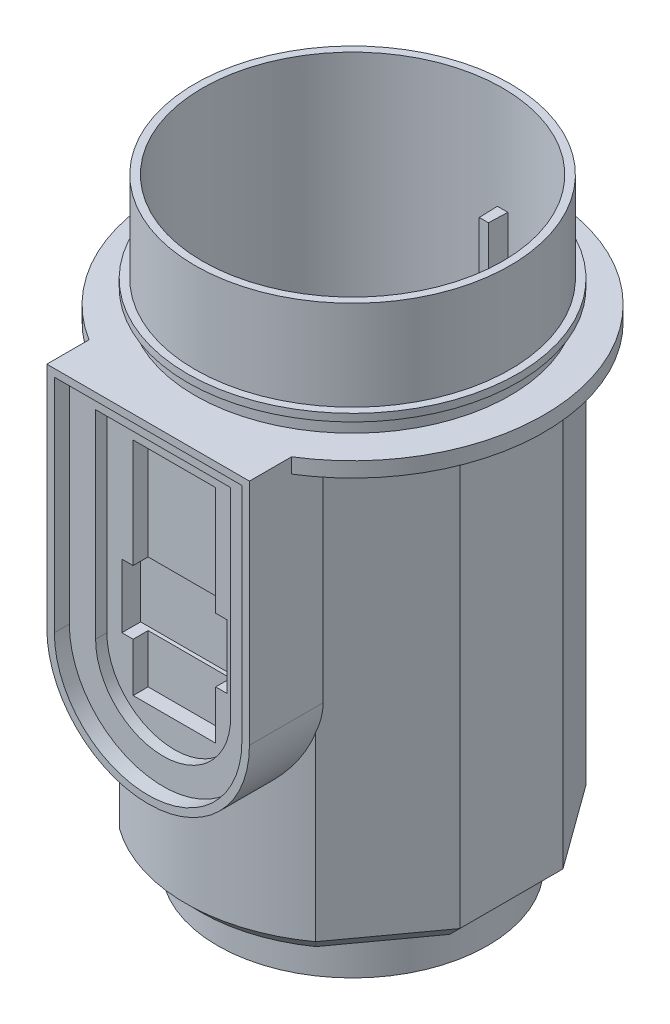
ISO-10303-21;
HEADER;
FILE_DESCRIPTION(('STEP AP214'),'2;1');
FILE_NAME('part.step','',(''),(''),'','','');
FILE_SCHEMA(('AUTOMOTIVE_DESIGN { 1 0 10303 214 1 1 1 1 }'));
ENDSEC;
DATA;
#1=APPLICATION_CONTEXT('core data for automotive mechanical design processes');
#2=APPLICATION_PROTOCOL_DEFINITION('international standard','automotive_design',2000,#1);
#3=PRODUCT_CONTEXT('',#1,'mechanical');
#4=PRODUCT('Part','Part','',(#3));
#5=PRODUCT_RELATED_PRODUCT_CATEGORY('part','',(#4));
#6=PRODUCT_DEFINITION_FORMATION('','',#4);
#7=PRODUCT_DEFINITION_CONTEXT('part definition',#1,'design');
#8=PRODUCT_DEFINITION('design','',#6,#7);
#9=PRODUCT_DEFINITION_SHAPE('','',#8);
#10=(LENGTH_UNIT() NAMED_UNIT(*) SI_UNIT(.MILLI.,.METRE.));
#11=(NAMED_UNIT(*) PLANE_ANGLE_UNIT() SI_UNIT($,.RADIAN.));
#12=(NAMED_UNIT(*) SI_UNIT($,.STERADIAN.) SOLID_ANGLE_UNIT());
#13=UNCERTAINTY_MEASURE_WITH_UNIT(LENGTH_MEASURE(1.E-05),#10,'distance_accuracy_value','');
#14=(GEOMETRIC_REPRESENTATION_CONTEXT(3) GLOBAL_UNCERTAINTY_ASSIGNED_CONTEXT((#13)) GLOBAL_UNIT_ASSIGNED_CONTEXT((#10,
#11,#12)) REPRESENTATION_CONTEXT('',''));
#15=CARTESIAN_POINT('',(0.,0.,0.));
#16=DIRECTION('',(0.,0.,1.));
#17=DIRECTION('',(1.,0.,0.));
#18=AXIS2_PLACEMENT_3D('',#15,#16,#17);
#19=CARTESIAN_POINT('',(-5.5,-6.5,21.75));
#20=DIRECTION('',(0.,0.,-1.));
#21=DIRECTION('',(-1.,0.,0.));
#22=AXIS2_PLACEMENT_3D('',#19,#20,#21);
#23=PLANE('',#22);
#24=DIRECTION('',(1.,0.,0.));
#25=VECTOR('',#24,1.);
#26=CARTESIAN_POINT('',(-7.,-29.5,21.75));
#27=LINE('',#26,#25);
#28=CARTESIAN_POINT('',(-5.5,-29.5,21.75));
#29=VERTEX_POINT('',#28);
#30=CARTESIAN_POINT('',(5.50000000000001,-29.5,21.75));
#31=VERTEX_POINT('',#30);
#32=EDGE_CURVE('E12',#29,#31,#27,.T.);
#33=ORIENTED_EDGE('',*,*,#32,.F.);
#34=DIRECTION('',(0.,-1.,0.));
#35=VECTOR('',#34,1.);
#36=CARTESIAN_POINT('',(-5.5,-36.,21.75));
#37=LINE('',#36,#35);
#38=CARTESIAN_POINT('',(-5.5,-36.,21.75));
#39=VERTEX_POINT('',#38);
#40=EDGE_CURVE('E524',#29,#39,#37,.T.);
#41=ORIENTED_EDGE('',*,*,#40,.T.);
#42=DIRECTION('',(1.,0.,0.));
#43=VECTOR('',#42,1.);
#44=CARTESIAN_POINT('',(5.50000000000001,-36.,21.75));
#45=LINE('',#44,#43);
#46=CARTESIAN_POINT('',(5.50000000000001,-36.,21.75));
#47=VERTEX_POINT('',#46);
#48=EDGE_CURVE('E520',#39,#47,#45,.T.);
#49=ORIENTED_EDGE('',*,*,#48,.T.);
#50=DIRECTION('',(0.,1.,0.));
#51=VECTOR('',#50,1.);
#52=CARTESIAN_POINT('',(5.50000000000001,-29.5,21.75));
#53=LINE('',#52,#51);
#54=EDGE_CURVE('E523',#47,#31,#53,.T.);
#55=ORIENTED_EDGE('',*,*,#54,.T.);
#56=EDGE_LOOP('',(#33,#41,#49,#55));
#57=FACE_BOUND('',#56,.T.);
#58=ADVANCED_FACE('F34',(#57),#23,.F.);
#59=DIRECTION('',(-1.,0.,0.));
#60=VECTOR('',#59,1.);
#61=CARTESIAN_POINT('',(-7.,-21.,21.75));
#62=LINE('',#61,#60);
#63=CARTESIAN_POINT('',(5.5,-21.,21.75));
#64=VERTEX_POINT('',#63);
#65=CARTESIAN_POINT('',(-5.5,-21.,21.75));
#66=VERTEX_POINT('',#65);
#67=EDGE_CURVE('E43',#64,#66,#62,.T.);
#68=ORIENTED_EDGE('',*,*,#67,.F.);
#69=DIRECTION('',(0.,1.,0.));
#70=VECTOR('',#69,1.);
#71=CARTESIAN_POINT('',(5.5,-6.5,21.75));
#72=LINE('',#71,#70);
#73=CARTESIAN_POINT('',(5.5,-6.5,21.75));
#74=VERTEX_POINT('',#73);
#75=EDGE_CURVE('E529',#64,#74,#72,.T.);
#76=ORIENTED_EDGE('',*,*,#75,.T.);
#77=DIRECTION('',(-1.,0.,0.));
#78=VECTOR('',#77,1.);
#79=CARTESIAN_POINT('',(-5.5,-6.5,21.75));
#80=LINE('',#79,#78);
#81=CARTESIAN_POINT('',(-5.5,-6.5,21.75));
#82=VERTEX_POINT('',#81);
#83=EDGE_CURVE('E525',#74,#82,#80,.T.);
#84=ORIENTED_EDGE('',*,*,#83,.T.);
#85=DIRECTION('',(0.,-1.,0.));
#86=VECTOR('',#85,1.);
#87=CARTESIAN_POINT('',(-5.5,-21.,21.75));
#88=LINE('',#87,#86);
#89=EDGE_CURVE('E519',#82,#66,#88,.T.);
#90=ORIENTED_EDGE('',*,*,#89,.T.);
#91=EDGE_LOOP('',(#68,#76,#84,#90));
#92=FACE_BOUND('',#91,.T.);
#93=ADVANCED_FACE('F942',(#92),#23,.F.);
#94=CARTESIAN_POINT('',(0.,49.4245856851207,0.));
#95=DIRECTION('',(0.,1.,0.));
#96=DIRECTION('',(0.,0.,1.));
#97=AXIS2_PLACEMENT_3D('',#94,#95,#96);
#98=CYLINDRICAL_SURFACE('',#97,20.);
#99=CARTESIAN_POINT('',(0.,15.,0.));
#100=DIRECTION('',(0.,1.,0.));
#101=DIRECTION('',(0.,0.,1.));
#102=AXIS2_PLACEMENT_3D('',#99,#100,#101);
#103=CIRCLE('',#102,20.);
#104=CARTESIAN_POINT('',(0.,15.,20.));
#105=VERTEX_POINT('',#104);
#106=EDGE_CURVE('E1981',#105,#105,#103,.T.);
#107=ORIENTED_EDGE('',*,*,#106,.T.);
#108=EDGE_LOOP('',(#107));
#109=FACE_BOUND('',#108,.T.);
#110=DIRECTION('',(0.,-1.,0.));
#111=VECTOR('',#110,1.);
#112=CARTESIAN_POINT('',(-0.697989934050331,1.,-19.9878165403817));
#113=LINE('',#112,#111);
#114=CARTESIAN_POINT('',(-0.697989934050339,1.,-19.9878165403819));
#115=VERTEX_POINT('',#114);
#116=CARTESIAN_POINT('',(-0.697989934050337,-59.,-19.9878165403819));
#117=VERTEX_POINT('',#116);
#118=EDGE_CURVE('E602',#115,#117,#113,.T.);
#119=ORIENTED_EDGE('',*,*,#118,.F.);
#120=CARTESIAN_POINT('',(0.,1.,0.));
#121=DIRECTION('',(0.,1.,0.));
#122=DIRECTION('',(0.,0.,-1.));
#123=AXIS2_PLACEMENT_3D('',#120,#121,#122);
#124=CIRCLE('',#123,19.9999999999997);
#125=CARTESIAN_POINT('',(0.697989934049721,1.,-19.9878165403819));
#126=VERTEX_POINT('',#125);
#127=EDGE_CURVE('E583',#126,#115,#124,.T.);
#128=ORIENTED_EDGE('',*,*,#127,.F.);
#129=DIRECTION('',(0.,-1.,0.));
#130=VECTOR('',#129,1.);
#131=CARTESIAN_POINT('',(0.697989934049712,1.,-19.9878165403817));
#132=LINE('',#131,#130);
#133=CARTESIAN_POINT('',(0.697989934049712,-59.,-19.9878165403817));
#134=VERTEX_POINT('',#133);
#135=EDGE_CURVE('E593',#126,#134,#132,.T.);
#136=ORIENTED_EDGE('',*,*,#135,.T.);
#137=CARTESIAN_POINT('',(0.,-59.,0.));
#138=DIRECTION('',(0.,1.,0.));
#139=DIRECTION('',(0.,0.,1.));
#140=AXIS2_PLACEMENT_3D('',#137,#138,#139);
#141=CIRCLE('',#140,20.);
#142=CARTESIAN_POINT('',(17.6589518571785,-59.,9.38943125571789));
#143=VERTEX_POINT('',#142);
#144=EDGE_CURVE('E1984',#143,#134,#141,.T.);
#145=ORIENTED_EDGE('',*,*,#144,.F.);
#146=DIRECTION('',(0.,-1.,0.));
#147=VECTOR('',#146,1.);
#148=CARTESIAN_POINT('',(17.6589518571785,1.,9.38943125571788));
#149=LINE('',#148,#147);
#150=CARTESIAN_POINT('',(17.6589518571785,1.,9.38943125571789));
#151=VERTEX_POINT('',#150);
#152=EDGE_CURVE('E695',#151,#143,#149,.T.);
#153=ORIENTED_EDGE('',*,*,#152,.F.);
#154=CARTESIAN_POINT('',(0.,1.,0.));
#155=DIRECTION('',(0.,1.,0.));
#156=DIRECTION('',(0.,0.,-1.));
#157=AXIS2_PLACEMENT_3D('',#154,#155,#156);
#158=CIRCLE('',#157,20.);
#159=CARTESIAN_POINT('',(16.9609619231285,1.,10.5983852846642));
#160=VERTEX_POINT('',#159);
#161=EDGE_CURVE('E676',#160,#151,#158,.T.);
#162=ORIENTED_EDGE('',*,*,#161,.F.);
#163=DIRECTION('',(0.,-1.,0.));
#164=VECTOR('',#163,1.);
#165=CARTESIAN_POINT('',(16.9609619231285,1.,10.5983852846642));
#166=LINE('',#165,#164);
#167=CARTESIAN_POINT('',(16.9609619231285,-59.,10.5983852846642));
#168=VERTEX_POINT('',#167);
#169=EDGE_CURVE('E686',#160,#168,#166,.T.);
#170=ORIENTED_EDGE('',*,*,#169,.T.);
#171=CARTESIAN_POINT('',(5.59379074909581,-59.,19.2018099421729));
#172=VERTEX_POINT('',#171);
#173=EDGE_CURVE('E1982',#172,#168,#141,.T.);
#174=ORIENTED_EDGE('',*,*,#173,.F.);
#175=DIRECTION('',(0.,-1.,0.));
#176=VECTOR('',#175,1.);
#177=CARTESIAN_POINT('',(5.5937907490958,1.,19.2018099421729));
#178=LINE('',#177,#176);
#179=CARTESIAN_POINT('',(5.59379074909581,1.,19.2018099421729));
#180=VERTEX_POINT('',#179);
#181=EDGE_CURVE('E664',#180,#172,#178,.T.);
#182=ORIENTED_EDGE('',*,*,#181,.F.);
#183=CARTESIAN_POINT('',(0.,1.,0.));
#184=DIRECTION('',(0.,1.,0.));
#185=DIRECTION('',(0.,0.,-1.));
#186=AXIS2_PLACEMENT_3D('',#183,#184,#185);
#187=CIRCLE('',#186,20.);
#188=CARTESIAN_POINT('',(4.56263001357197,1.,19.4726065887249));
#189=VERTEX_POINT('',#188);
#190=EDGE_CURVE('E645',#189,#180,#187,.T.);
#191=ORIENTED_EDGE('',*,*,#190,.F.);
#192=DIRECTION('',(0.,-1.,0.));
#193=VECTOR('',#192,1.);
#194=CARTESIAN_POINT('',(4.56263001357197,1.,19.4726065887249));
#195=LINE('',#194,#193);
#196=CARTESIAN_POINT('',(4.56263001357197,-59.,19.4726065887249));
#197=VERTEX_POINT('',#196);
#198=EDGE_CURVE('E655',#189,#197,#195,.T.);
#199=ORIENTED_EDGE('',*,*,#198,.T.);
#200=CARTESIAN_POINT('',(-4.56263001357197,-59.,19.4726065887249));
#201=VERTEX_POINT('',#200);
#202=EDGE_CURVE('E1979',#201,#197,#141,.T.);
#203=ORIENTED_EDGE('',*,*,#202,.F.);
#204=DIRECTION('',(0.,-1.,0.));
#205=VECTOR('',#204,1.);
#206=CARTESIAN_POINT('',(-4.56263001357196,1.,19.4726065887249));
#207=LINE('',#206,#205);
#208=CARTESIAN_POINT('',(-4.56263001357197,1.,19.4726065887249));
#209=VERTEX_POINT('',#208);
#210=EDGE_CURVE('E721',#209,#201,#207,.T.);
#211=ORIENTED_EDGE('',*,*,#210,.F.);
#212=CARTESIAN_POINT('',(0.,1.,0.));
#213=DIRECTION('',(0.,1.,0.));
#214=DIRECTION('',(0.,0.,1.));
#215=AXIS2_PLACEMENT_3D('',#212,#213,#214);
#216=CIRCLE('',#215,20.);
#217=CARTESIAN_POINT('',(-5.5937907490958,1.,19.2018099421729));
#218=VERTEX_POINT('',#217);
#219=EDGE_CURVE('E713',#218,#209,#216,.T.);
#220=ORIENTED_EDGE('',*,*,#219,.F.);
#221=DIRECTION('',(0.,-1.,0.));
#222=VECTOR('',#221,1.);
#223=CARTESIAN_POINT('',(-5.5937907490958,1.,19.2018099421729));
#224=LINE('',#223,#222);
#225=CARTESIAN_POINT('',(-5.5937907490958,-59.,19.2018099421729));
#226=VERTEX_POINT('',#225);
#227=EDGE_CURVE('E724',#218,#226,#224,.T.);
#228=ORIENTED_EDGE('',*,*,#227,.T.);
#229=CARTESIAN_POINT('',(-16.9609619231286,-59.,10.598385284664));
#230=VERTEX_POINT('',#229);
#231=EDGE_CURVE('E1978',#230,#226,#141,.T.);
#232=ORIENTED_EDGE('',*,*,#231,.F.);
#233=DIRECTION('',(0.,-1.,0.));
#234=VECTOR('',#233,1.);
#235=CARTESIAN_POINT('',(-16.9609619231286,1.,10.5983852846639));
#236=LINE('',#235,#234);
#237=CARTESIAN_POINT('',(-16.9609619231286,1.,10.598385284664));
#238=VERTEX_POINT('',#237);
#239=EDGE_CURVE('E633',#238,#230,#236,.T.);
#240=ORIENTED_EDGE('',*,*,#239,.F.);
#241=CARTESIAN_POINT('',(0.,1.,0.));
#242=DIRECTION('',(0.,1.,0.));
#243=DIRECTION('',(0.,0.,-1.));
#244=AXIS2_PLACEMENT_3D('',#241,#242,#243);
#245=CIRCLE('',#244,20.);
#246=CARTESIAN_POINT('',(-17.6589518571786,1.,9.38943125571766));
#247=VERTEX_POINT('',#246);
#248=EDGE_CURVE('E614',#247,#238,#245,.T.);
#249=ORIENTED_EDGE('',*,*,#248,.F.);
#250=DIRECTION('',(0.,-1.,0.));
#251=VECTOR('',#250,1.);
#252=CARTESIAN_POINT('',(-17.6589518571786,1.,9.38943125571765));
#253=LINE('',#252,#251);
#254=CARTESIAN_POINT('',(-17.6589518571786,-59.,9.38943125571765));
#255=VERTEX_POINT('',#254);
#256=EDGE_CURVE('E624',#247,#255,#253,.T.);
#257=ORIENTED_EDGE('',*,*,#256,.T.);
#258=EDGE_CURVE('E1983',#117,#255,#141,.T.);
#259=ORIENTED_EDGE('',*,*,#258,.F.);
#260=EDGE_LOOP('',(#119,#128,#136,#145,#153,#162,#170,#174,#182,#191,#199,#203,#211,#220,#228,
#232,#240,#249,#257,#259));
#261=FACE_BOUND('',#260,.T.);
#262=ADVANCED_FACE('F1474',(#109,#261),#98,.F.);
#263=CARTESIAN_POINT('',(20.,-59.,0.));
#264=DIRECTION('',(0.,-1.,0.));
#265=DIRECTION('',(0.,0.,-1.));
#266=AXIS2_PLACEMENT_3D('',#263,#264,#265);
#267=PLANE('',#266);
#268=DIRECTION('',(0.0348994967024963,0.,0.999390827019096));
#269=VECTOR('',#268,1.);
#270=CARTESIAN_POINT('',(-0.697989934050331,-59.,-19.9878165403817));
#271=LINE('',#270,#269);
#272=CARTESIAN_POINT('',(-0.61074119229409,-59.,-17.4893394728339));
#273=VERTEX_POINT('',#272);
#274=EDGE_CURVE('E569',#117,#273,#271,.T.);
#275=ORIENTED_EDGE('',*,*,#274,.F.);
#276=ORIENTED_EDGE('',*,*,#258,.T.);
#277=DIRECTION('',(-0.882947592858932,0.,0.469471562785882));
#278=VECTOR('',#277,1.);
#279=CARTESIAN_POINT('',(-17.6589518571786,-59.,9.38943125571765));
#280=LINE('',#279,#278);
#281=CARTESIAN_POINT('',(-15.4515828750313,-59.,8.21575234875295));
#282=VERTEX_POINT('',#281);
#283=EDGE_CURVE('E611',#282,#255,#280,.T.);
#284=ORIENTED_EDGE('',*,*,#283,.F.);
#285=CARTESIAN_POINT('',(0.,-59.,0.));
#286=DIRECTION('',(0.,-1.,0.));
#287=DIRECTION('',(0.,0.,-1.));
#288=AXIS2_PLACEMENT_3D('',#285,#286,#287);
#289=CIRCLE('',#288,17.5);
#290=CARTESIAN_POINT('',(-14.8408416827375,-59.,9.27358712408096));
#291=VERTEX_POINT('',#290);
#292=EDGE_CURVE('E608',#291,#282,#289,.T.);
#293=ORIENTED_EDGE('',*,*,#292,.F.);
#294=DIRECTION('',(0.848048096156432,0.,-0.529919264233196));
#295=VECTOR('',#294,1.);
#296=CARTESIAN_POINT('',(-16.9609619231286,-59.,10.5983852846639));
#297=LINE('',#296,#295);
#298=EDGE_CURVE('E605',#230,#291,#297,.T.);
#299=ORIENTED_EDGE('',*,*,#298,.F.);
#300=ORIENTED_EDGE('',*,*,#231,.T.);
#301=DIRECTION('',(-0.573576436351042,0.,0.819152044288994));
#302=VECTOR('',#301,1.);
#303=CARTESIAN_POINT('',(-5.5937907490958,-59.,19.2018099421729));
#304=LINE('',#303,#302);
#305=CARTESIAN_POINT('',(-4.06671711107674,-59.,17.0209227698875));
#306=VERTEX_POINT('',#305);
#307=EDGE_CURVE('E701',#306,#226,#304,.T.);
#308=ORIENTED_EDGE('',*,*,#307,.F.);
#309=CARTESIAN_POINT('',(0.,-59.,0.));
#310=DIRECTION('',(0.,-1.,0.));
#311=DIRECTION('',(0.,0.,1.));
#312=AXIS2_PLACEMENT_3D('',#309,#310,#311);
#313=CIRCLE('',#312,17.5);
#314=CARTESIAN_POINT('',(-2.99999999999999,-59.,17.2409396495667));
#315=VERTEX_POINT('',#314);
#316=EDGE_CURVE('E698',#315,#306,#313,.T.);
#317=ORIENTED_EDGE('',*,*,#316,.F.);
#318=DIRECTION('',(0.573576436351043,0.,-0.819152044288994));
#319=VECTOR('',#318,1.);
#320=CARTESIAN_POINT('',(-4.56263001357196,-59.,19.4726065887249));
#321=LINE('',#320,#319);
#322=EDGE_CURVE('E704',#201,#315,#321,.T.);
#323=ORIENTED_EDGE('',*,*,#322,.F.);
#324=ORIENTED_EDGE('',*,*,#202,.T.);
#325=DIRECTION('',(0.573576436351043,0.,0.819152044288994));
#326=VECTOR('',#325,1.);
#327=CARTESIAN_POINT('',(4.56263001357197,-59.,19.4726065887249));
#328=LINE('',#327,#326);
#329=CARTESIAN_POINT('',(3.,-59.,17.2409396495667));
#330=VERTEX_POINT('',#329);
#331=EDGE_CURVE('E642',#330,#197,#328,.T.);
#332=ORIENTED_EDGE('',*,*,#331,.F.);
#333=CARTESIAN_POINT('',(0.,-59.,0.));
#334=DIRECTION('',(0.,-1.,0.));
#335=DIRECTION('',(0.,0.,-1.));
#336=AXIS2_PLACEMENT_3D('',#333,#334,#335);
#337=CIRCLE('',#336,17.5);
#338=CARTESIAN_POINT('',(4.06671711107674,-59.,17.0209227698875));
#339=VERTEX_POINT('',#338);
#340=EDGE_CURVE('E639',#339,#330,#337,.T.);
#341=ORIENTED_EDGE('',*,*,#340,.F.);
#342=DIRECTION('',(-0.573576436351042,0.,-0.819152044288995));
#343=VECTOR('',#342,1.);
#344=CARTESIAN_POINT('',(5.5937907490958,-59.,19.2018099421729));
#345=LINE('',#344,#343);
#346=EDGE_CURVE('E636',#172,#339,#345,.T.);
#347=ORIENTED_EDGE('',*,*,#346,.F.);
#348=ORIENTED_EDGE('',*,*,#173,.T.);
#349=DIRECTION('',(0.848048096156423,0.,0.529919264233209));
#350=VECTOR('',#349,1.);
#351=CARTESIAN_POINT('',(16.9609619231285,-59.,10.5983852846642));
#352=LINE('',#351,#350);
#353=CARTESIAN_POINT('',(14.8408416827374,-59.,9.27358712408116));
#354=VERTEX_POINT('',#353);
#355=EDGE_CURVE('E673',#354,#168,#352,.T.);
#356=ORIENTED_EDGE('',*,*,#355,.F.);
#357=CARTESIAN_POINT('',(0.,-59.,0.));
#358=DIRECTION('',(0.,-1.,0.));
#359=DIRECTION('',(0.,0.,-1.));
#360=AXIS2_PLACEMENT_3D('',#357,#358,#359);
#361=CIRCLE('',#360,17.5);
#362=CARTESIAN_POINT('',(15.4515828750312,-59.,8.21575234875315));
#363=VERTEX_POINT('',#362);
#364=EDGE_CURVE('E670',#363,#354,#361,.T.);
#365=ORIENTED_EDGE('',*,*,#364,.F.);
#366=DIRECTION('',(-0.882947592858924,0.,-0.469471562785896));
#367=VECTOR('',#366,1.);
#368=CARTESIAN_POINT('',(17.6589518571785,-59.,9.38943125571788));
#369=LINE('',#368,#367);
#370=EDGE_CURVE('E667',#143,#363,#369,.T.);
#371=ORIENTED_EDGE('',*,*,#370,.F.);
#372=ORIENTED_EDGE('',*,*,#144,.T.);
#373=DIRECTION('',(0.0348994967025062,0.,-0.999390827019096));
#374=VECTOR('',#373,1.);
#375=CARTESIAN_POINT('',(0.697989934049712,-59.,-19.9878165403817));
#376=LINE('',#375,#374);
#377=CARTESIAN_POINT('',(0.610741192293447,-59.,-17.4893394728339));
#378=VERTEX_POINT('',#377);
#379=EDGE_CURVE('E580',#378,#134,#376,.T.);
#380=ORIENTED_EDGE('',*,*,#379,.F.);
#381=CARTESIAN_POINT('',(0.,-59.,0.));
#382=DIRECTION('',(0.,-1.,0.));
#383=DIRECTION('',(0.,0.,-1.));
#384=AXIS2_PLACEMENT_3D('',#381,#382,#383);
#385=CIRCLE('',#384,17.4999999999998);
#386=EDGE_CURVE('E577',#273,#378,#385,.T.);
#387=ORIENTED_EDGE('',*,*,#386,.F.);
#388=EDGE_LOOP('',(#275,#276,#284,#293,#299,#300,#308,#317,#323,#324,#332,#341,#347,#348,#356,
#365,#371,#372,#380,#387));
#389=FACE_BOUND('',#388,.T.);
#390=ADVANCED_FACE('F1467',(#389),#267,.F.);
#391=CARTESIAN_POINT('',(0.,49.4245856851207,0.));
#392=DIRECTION('',(0.,1.,0.));
#393=DIRECTION('',(0.,0.,1.));
#394=AXIS2_PLACEMENT_3D('',#391,#392,#393);
#395=CYLINDRICAL_SURFACE('',#394,16.);
#396=CARTESIAN_POINT('',(0.,-60.,0.));
#397=DIRECTION('',(0.,1.,0.));
#398=DIRECTION('',(0.,0.,1.));
#399=AXIS2_PLACEMENT_3D('',#396,#397,#398);
#400=CIRCLE('',#399,16.);
#401=CARTESIAN_POINT('',(0.,-60.,16.));
#402=VERTEX_POINT('',#401);
#403=EDGE_CURVE('E1975',#402,#402,#400,.T.);
#404=ORIENTED_EDGE('',*,*,#403,.T.);
#405=EDGE_LOOP('',(#404));
#406=FACE_BOUND('',#405,.T.);
#407=CARTESIAN_POINT('',(0.,-65.,0.));
#408=DIRECTION('',(0.,1.,0.));
#409=DIRECTION('',(0.,0.,1.));
#410=AXIS2_PLACEMENT_3D('',#407,#408,#409);
#411=CIRCLE('',#410,16.);
#412=CARTESIAN_POINT('',(0.,-65.,16.));
#413=VERTEX_POINT('',#412);
#414=EDGE_CURVE('E1972',#413,#413,#411,.T.);
#415=ORIENTED_EDGE('',*,*,#414,.F.);
#416=EDGE_LOOP('',(#415));
#417=FACE_BOUND('',#416,.T.);
#418=DIRECTION('',(0.,-1.,0.));
#419=VECTOR('',#418,1.);
#420=CARTESIAN_POINT('',(15.612494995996,-63.3,-3.5));
#421=LINE('',#420,#419);
#422=CARTESIAN_POINT('',(15.612494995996,-63.3,-3.5));
#423=VERTEX_POINT('',#422);
#424=CARTESIAN_POINT('',(15.612494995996,-64.8,-3.5));
#425=VERTEX_POINT('',#424);
#426=EDGE_CURVE('E1855',#423,#425,#421,.T.);
#427=ORIENTED_EDGE('',*,*,#426,.F.);
#428=CARTESIAN_POINT('',(0.,-63.3,0.));
#429=DIRECTION('',(0.,-1.,0.));
#430=DIRECTION('',(0.,0.,1.));
#431=AXIS2_PLACEMENT_3D('',#428,#429,#430);
#432=CIRCLE('',#431,16.);
#433=CARTESIAN_POINT('',(15.612494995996,-63.3,3.5));
#434=VERTEX_POINT('',#433);
#435=EDGE_CURVE('E1843',#423,#434,#432,.T.);
#436=ORIENTED_EDGE('',*,*,#435,.T.);
#437=DIRECTION('',(0.,-1.,0.));
#438=VECTOR('',#437,1.);
#439=CARTESIAN_POINT('',(15.612494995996,-63.3,3.5));
#440=LINE('',#439,#438);
#441=CARTESIAN_POINT('',(15.612494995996,-64.8,3.5));
#442=VERTEX_POINT('',#441);
#443=EDGE_CURVE('E1854',#434,#442,#440,.T.);
#444=ORIENTED_EDGE('',*,*,#443,.T.);
#445=CARTESIAN_POINT('',(0.,-64.8,0.));
#446=DIRECTION('',(0.,-1.,0.));
#447=DIRECTION('',(0.,0.,1.));
#448=AXIS2_PLACEMENT_3D('',#445,#446,#447);
#449=CIRCLE('',#448,16.);
#450=EDGE_CURVE('E1824',#425,#442,#449,.T.);
#451=ORIENTED_EDGE('',*,*,#450,.F.);
#452=EDGE_LOOP('',(#427,#436,#444,#451));
#453=FACE_BOUND('',#452,.T.);
#454=CARTESIAN_POINT('',(0.,-63.3,0.));
#455=DIRECTION('',(0.,-1.,0.));
#456=DIRECTION('',(0.,0.,-1.));
#457=AXIS2_PLACEMENT_3D('',#454,#455,#456);
#458=CIRCLE('',#457,16.);
#459=CARTESIAN_POINT('',(-15.612494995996,-63.3,3.5));
#460=VERTEX_POINT('',#459);
#461=CARTESIAN_POINT('',(-15.612494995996,-63.3,-3.49999999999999));
#462=VERTEX_POINT('',#461);
#463=EDGE_CURVE('E1815',#460,#462,#458,.T.);
#464=ORIENTED_EDGE('',*,*,#463,.T.);
#465=DIRECTION('',(0.,-1.,0.));
#466=VECTOR('',#465,1.);
#467=CARTESIAN_POINT('',(-15.612494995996,-63.3,-3.49999999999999));
#468=LINE('',#467,#466);
#469=CARTESIAN_POINT('',(-15.612494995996,-64.8,-3.49999999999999));
#470=VERTEX_POINT('',#469);
#471=EDGE_CURVE('E1825',#462,#470,#468,.T.);
#472=ORIENTED_EDGE('',*,*,#471,.T.);
#473=CARTESIAN_POINT('',(0.,-64.8,0.));
#474=DIRECTION('',(0.,-1.,0.));
#475=DIRECTION('',(0.,0.,-1.));
#476=AXIS2_PLACEMENT_3D('',#473,#474,#475);
#477=CIRCLE('',#476,16.);
#478=CARTESIAN_POINT('',(-15.612494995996,-64.8,3.5));
#479=VERTEX_POINT('',#478);
#480=EDGE_CURVE('E1804',#479,#470,#477,.T.);
#481=ORIENTED_EDGE('',*,*,#480,.F.);
#482=DIRECTION('',(0.,-1.,0.));
#483=VECTOR('',#482,1.);
#484=CARTESIAN_POINT('',(-15.612494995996,-63.3,3.5));
#485=LINE('',#484,#483);
#486=EDGE_CURVE('E1828',#460,#479,#485,.T.);
#487=ORIENTED_EDGE('',*,*,#486,.F.);
#488=EDGE_LOOP('',(#464,#472,#481,#487));
#489=FACE_BOUND('',#488,.T.);
#490=ADVANCED_FACE('F1460',(#406,#417,#453,#489),#395,.F.);
#491=CARTESIAN_POINT('',(0.,49.4245856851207,0.));
#492=DIRECTION('',(0.,1.,0.));
#493=DIRECTION('',(0.,0.,1.));
#494=AXIS2_PLACEMENT_3D('',#491,#492,#493);
#495=CYLINDRICAL_SURFACE('',#494,22.25);
#496=DIRECTION('',(0.,1.,0.));
#497=VECTOR('',#496,1.);
#498=CARTESIAN_POINT('',(13.0782218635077,-65.,18.0006281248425));
#499=LINE('',#498,#497);
#500=CARTESIAN_POINT('',(13.0782218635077,-58.,18.0006281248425));
#501=VERTEX_POINT('',#500);
#502=CARTESIAN_POINT('',(13.0782218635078,-33.8481506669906,18.0006281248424));
#503=VERTEX_POINT('',#502);
#504=EDGE_CURVE('E1931',#501,#503,#499,.T.);
#505=ORIENTED_EDGE('',*,*,#504,.T.);
#506=CARTESIAN_POINT('',(-13.5,-30.5,17.686506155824));
#507=CARTESIAN_POINT('',(-13.5000021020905,-30.6702545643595,17.6865000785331));
#508=CARTESIAN_POINT('',(-13.4967784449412,-30.8404826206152,17.6889656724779));
#509=CARTESIAN_POINT('',(-13.4839092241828,-31.1805427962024,17.6987792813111));
#510=CARTESIAN_POINT('',(-13.4742641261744,-31.3503749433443,17.7061269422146));
#511=CARTESIAN_POINT('',(-13.4357724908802,-31.8583764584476,17.7353777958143));
#512=CARTESIAN_POINT('',(-13.3973694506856,-32.19547828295,17.7644891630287));
#513=CARTESIAN_POINT('',(-13.2961636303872,-32.8610347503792,17.8403601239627));
#514=CARTESIAN_POINT('',(-13.2335629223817,-33.1895375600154,17.8869734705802));
#515=CARTESIAN_POINT('',(-13.0849108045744,-33.8385583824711,17.9960021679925));
#516=CARTESIAN_POINT('',(-12.9988545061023,-34.1590747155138,18.0584208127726));
#517=CARTESIAN_POINT('',(-12.8047885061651,-34.7890073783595,18.1965375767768));
#518=CARTESIAN_POINT('',(-12.6968651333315,-35.0984618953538,18.2721833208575));
#519=CARTESIAN_POINT('',(-12.4600464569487,-35.7061186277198,18.4344890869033));
#520=CARTESIAN_POINT('',(-12.331151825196,-36.0043212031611,18.5211487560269));
#521=CARTESIAN_POINT('',(-11.9138939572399,-36.8819230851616,18.7944669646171));
#522=CARTESIAN_POINT('',(-11.5952712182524,-37.4433095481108,18.9942302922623));
#523=CARTESIAN_POINT('',(-11.0409348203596,-38.2767539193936,19.3187462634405));
#524=CARTESIAN_POINT('',(-10.8299133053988,-38.5679623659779,19.4380910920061));
#525=CARTESIAN_POINT('',(-10.3857538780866,-39.1322012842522,19.6789827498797));
#526=CARTESIAN_POINT('',(-10.1526146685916,-39.40523068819,19.8005297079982));
#527=CARTESIAN_POINT('',(-9.66512516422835,-39.9320861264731,20.0430041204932));
#528=CARTESIAN_POINT('',(-9.41076813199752,-40.1859060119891,20.1639313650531));
#529=CARTESIAN_POINT('',(-8.88176104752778,-40.6731819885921,20.4024756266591));
#530=CARTESIAN_POINT('',(-8.60710993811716,-40.906637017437,20.5200924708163));
#531=CARTESIAN_POINT('',(-8.00665635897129,-41.3767930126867,20.7622758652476));
#532=CARTESIAN_POINT('',(-7.67856739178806,-41.6109422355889,20.8861506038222));
#533=CARTESIAN_POINT('',(-6.99996023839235,-42.0504969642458,21.1232629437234));
#534=CARTESIAN_POINT('',(-6.64943994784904,-42.2558997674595,21.2364995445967));
#535=CARTESIAN_POINT('',(-5.9281728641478,-42.6355978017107,21.4490209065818));
#536=CARTESIAN_POINT('',(-5.55743946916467,-42.8099133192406,21.5483147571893));
#537=CARTESIAN_POINT('',(-4.7981007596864,-43.1252583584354,21.7300029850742));
#538=CARTESIAN_POINT('',(-4.40949847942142,-43.266293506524,21.8124002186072));
#539=CARTESIAN_POINT('',(-3.65610832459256,-43.500887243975,21.9505693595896));
#540=CARTESIAN_POINT('',(-3.2926726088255,-43.5977263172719,22.0081498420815));
#541=CARTESIAN_POINT('',(-2.55671001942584,-43.7610430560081,22.105733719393));
#542=CARTESIAN_POINT('',(-2.18418368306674,-43.8275225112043,22.1457381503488));
#543=CARTESIAN_POINT('',(-1.43363825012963,-43.9289975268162,22.2069547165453));
#544=CARTESIAN_POINT('',(-1.05562382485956,-43.964018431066,22.2281819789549));
#545=CARTESIAN_POINT('',(-0.297412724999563,-44.0020582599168,22.2512435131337));
#546=CARTESIAN_POINT('',(0.0827837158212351,-44.0050805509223,22.253079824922));
#547=CARTESIAN_POINT('',(0.793462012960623,-43.9807397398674,22.2383180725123));
#548=CARTESIAN_POINT('',(1.12413084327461,-43.9571834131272,22.2240294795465));
#549=CARTESIAN_POINT('',(1.78188091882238,-43.8859739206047,22.1809825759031));
#550=CARTESIAN_POINT('',(2.10896253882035,-43.8383232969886,22.1522257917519));
#551=CARTESIAN_POINT('',(2.75729371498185,-43.7195295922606,22.0809015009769));
#552=CARTESIAN_POINT('',(3.07854307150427,-43.6483857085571,22.0383335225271));
#553=CARTESIAN_POINT('',(3.71316189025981,-43.4834482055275,21.9403288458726));
#554=CARTESIAN_POINT('',(4.02653102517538,-43.3896536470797,21.8848916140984));
#555=CARTESIAN_POINT('',(4.64509670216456,-43.1799156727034,21.7620197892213));
#556=CARTESIAN_POINT('',(4.95024574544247,-43.0638661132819,21.69452781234));
#557=CARTESIAN_POINT('',(5.54922897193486,-42.8110415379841,21.5490963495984));
#558=CARTESIAN_POINT('',(5.84306326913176,-42.6742667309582,21.4711569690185));
#559=CARTESIAN_POINT('',(6.41818111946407,-42.3811253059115,21.3063124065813));
#560=CARTESIAN_POINT('',(6.69946375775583,-42.2247572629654,21.2194065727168));
#561=CARTESIAN_POINT('',(7.24845042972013,-41.8935404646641,21.0382044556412));
#562=CARTESIAN_POINT('',(7.51615302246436,-41.7186897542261,20.9439073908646));
#563=CARTESIAN_POINT('',(8.06857530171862,-41.3293877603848,20.7378316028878));
#564=CARTESIAN_POINT('',(8.3514488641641,-41.1127040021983,20.6253166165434));
#565=CARTESIAN_POINT('',(8.89807594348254,-40.6587642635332,20.3954573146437));
#566=CARTESIAN_POINT('',(9.16182813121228,-40.421506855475,20.2781126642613));
#567=CARTESIAN_POINT('',(9.66974285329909,-39.9271864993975,20.0408894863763));
#568=CARTESIAN_POINT('',(9.91387377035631,-39.6700928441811,19.9210072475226));
#569=CARTESIAN_POINT('',(10.3812305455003,-39.137454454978,19.6815020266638));
#570=CARTESIAN_POINT('',(10.6044553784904,-38.8619088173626,19.5618790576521));
#571=CARTESIAN_POINT('',(11.0547979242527,-38.2588409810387,19.3113456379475));
#572=CARTESIAN_POINT('',(11.279128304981,-37.9290609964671,19.1808173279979));
#573=CARTESIAN_POINT('',(11.5939101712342,-37.4189008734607,18.9910186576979));
#574=CARTESIAN_POINT('',(11.6952274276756,-37.2462480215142,18.9287455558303));
#575=CARTESIAN_POINT('',(11.8904755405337,-36.8958452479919,18.8067101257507));
#576=CARTESIAN_POINT('',(11.9844032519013,-36.7180931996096,18.7469488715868));
#577=CARTESIAN_POINT('',(12.2540613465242,-36.178830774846,18.5727264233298));
#578=CARTESIAN_POINT('',(12.4184492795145,-35.8100481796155,18.4628483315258));
#579=CARTESIAN_POINT('',(12.7147115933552,-35.0552559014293,18.2600903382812));
#580=CARTESIAN_POINT('',(12.8465985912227,-34.6692529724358,18.1672038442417));
#581=CARTESIAN_POINT('',(13.0489365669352,-33.9747272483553,18.0221917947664));
#582=CARTESIAN_POINT('',(13.1265419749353,-33.6692079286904,17.9656142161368));
#583=CARTESIAN_POINT('',(13.2604924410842,-33.0513178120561,17.8669745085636));
#584=CARTESIAN_POINT('',(13.3168447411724,-32.7389493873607,17.8249074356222));
#585=CARTESIAN_POINT('',(13.4078463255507,-32.1069434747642,17.7565608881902));
#586=CARTESIAN_POINT('',(13.4423347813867,-31.7872696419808,17.7303984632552));
#587=CARTESIAN_POINT('',(13.4768967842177,-31.3057456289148,17.7041219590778));
#588=CARTESIAN_POINT('',(13.4855557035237,-31.1448043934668,17.6975242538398));
#589=CARTESIAN_POINT('',(13.4971083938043,-30.8225829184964,17.6887137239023));
#590=CARTESIAN_POINT('',(13.5000017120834,-30.6613026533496,17.6865012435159));
#591=CARTESIAN_POINT('',(13.5,-30.5,17.686506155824));
#592=B_SPLINE_CURVE_WITH_KNOTS('',3,(#506,#507,#508,#509,#510,#511,#512,#513,#514,#515,#516,
#517,#518,#519,#520,#521,#522,#523,#524,#525,#526,#527,#528,#529,#530,#531,#532,#533,#534,#535,
#536,#537,#538,#539,#540,#541,#542,#543,#544,#545,#546,#547,#548,#549,#550,#551,#552,#553,#554,
#555,#556,#557,#558,#559,#560,#561,#562,#563,#564,#565,#566,#567,#568,#569,#570,#571,#572,#573,
#574,#575,#576,#577,#578,#579,#580,#581,#582,#583,#584,#585,#586,#587,#588,#589,#590,#591),
.UNSPECIFIED.,.F.,.F.,(4,2,2,2,2,2,2,2,2,2,2,2,2,2,2,2,2,2,2,2,2,2,2,2,2,2,2,2,2,2,2,2,2,2,2,2,
2,2,2,2,2,2,4),(0.,0.510663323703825,1.02128962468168,2.04126528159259,3.05290110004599,
4.0647479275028,5.07267532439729,6.0805704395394,8.0995709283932,9.2354805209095,
10.3714567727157,11.5077951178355,12.6441926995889,13.9075612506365,15.1710484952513,
16.4337081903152,17.6961542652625,18.8360012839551,19.9757810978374,21.1146418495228,
22.2533827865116,23.2476352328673,24.2417827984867,25.2359643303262,26.2301870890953,
27.2292752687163,28.2283533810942,29.2275041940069,30.2267608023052,31.3466290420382,
32.4665750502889,33.5882909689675,34.710061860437,35.9673460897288,36.5961122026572,
37.2251444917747,38.4785365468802,39.7314412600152,40.691192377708,41.6506161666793,
42.6170179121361,43.1008027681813,43.5846256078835),.UNSPECIFIED.);
#593=CARTESIAN_POINT('',(-13.0782218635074,-33.8481506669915,18.0006281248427));
#594=VERTEX_POINT('',#593);
#595=EDGE_CURVE('E765',#594,#503,#592,.T.);
#596=ORIENTED_EDGE('',*,*,#595,.F.);
#597=DIRECTION('',(0.,1.,0.));
#598=VECTOR('',#597,1.);
#599=CARTESIAN_POINT('',(-13.0782218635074,-65.,18.0006281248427));
#600=LINE('',#599,#598);
#601=CARTESIAN_POINT('',(-13.0782218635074,-58.,18.0006281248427));
#602=VERTEX_POINT('',#601);
#603=EDGE_CURVE('E1928',#602,#594,#600,.T.);
#604=ORIENTED_EDGE('',*,*,#603,.F.);
#605=CARTESIAN_POINT('',(0.,-58.,0.));
#606=DIRECTION('',(0.,1.,0.));
#607=DIRECTION('',(0.,0.,1.));
#608=AXIS2_PLACEMENT_3D('',#605,#606,#607);
#609=CIRCLE('',#608,22.25);
#610=EDGE_CURVE('E1987',#602,#501,#609,.T.);
#611=ORIENTED_EDGE('',*,*,#610,.T.);
#612=EDGE_LOOP('',(#505,#596,#604,#611));
#613=FACE_BOUND('',#612,.T.);
#614=ADVANCED_FACE('F1454',(#613),#495,.T.);
#615=CARTESIAN_POINT('',(21.,15.,0.));
#616=DIRECTION('',(0.,-1.,0.));
#617=DIRECTION('',(0.,0.,-1.));
#618=AXIS2_PLACEMENT_3D('',#615,#616,#617);
#619=PLANE('',#618);
#620=ORIENTED_EDGE('',*,*,#106,.F.);
#621=EDGE_LOOP('',(#620));
#622=FACE_BOUND('',#621,.T.);
#623=CARTESIAN_POINT('',(0.,15.,0.));
#624=DIRECTION('',(0.,1.,0.));
#625=DIRECTION('',(0.,0.,1.));
#626=AXIS2_PLACEMENT_3D('',#623,#624,#625);
#627=CIRCLE('',#626,21.);
#628=CARTESIAN_POINT('',(0.,15.,21.));
#629=VERTEX_POINT('',#628);
#630=EDGE_CURVE('E1942',#629,#629,#627,.T.);
#631=ORIENTED_EDGE('',*,*,#630,.T.);
#632=EDGE_LOOP('',(#631));
#633=FACE_BOUND('',#632,.T.);
#634=ADVANCED_FACE('F36',(#622,#633),#619,.F.);
#635=CARTESIAN_POINT('',(0.,-60.,0.));
#636=DIRECTION('',(0.,1.,0.));
#637=DIRECTION('',(0.,0.,1.));
#638=AXIS2_PLACEMENT_3D('',#635,#636,#637);
#639=PLANE('',#638);
#640=ORIENTED_EDGE('',*,*,#403,.F.);
#641=EDGE_LOOP('',(#640));
#642=FACE_BOUND('',#641,.T.);
#643=ADVANCED_FACE('F1439',(#642),#639,.F.);
#644=CARTESIAN_POINT('',(16.,-65.,0.));
#645=DIRECTION('',(0.,1.,0.));
#646=DIRECTION('',(0.,0.,1.));
#647=AXIS2_PLACEMENT_3D('',#644,#645,#646);
#648=PLANE('',#647);
#649=CARTESIAN_POINT('',(0.,-65.,0.));
#650=DIRECTION('',(0.,1.,0.));
#651=DIRECTION('',(0.,0.,1.));
#652=AXIS2_PLACEMENT_3D('',#649,#650,#651);
#653=CIRCLE('',#652,18.);
#654=CARTESIAN_POINT('',(0.,-65.,18.));
#655=VERTEX_POINT('',#654);
#656=EDGE_CURVE('E1969',#655,#655,#653,.T.);
#657=ORIENTED_EDGE('',*,*,#656,.F.);
#658=EDGE_LOOP('',(#657));
#659=FACE_BOUND('',#658,.T.);
#660=ORIENTED_EDGE('',*,*,#414,.T.);
#661=EDGE_LOOP('',(#660));
#662=FACE_BOUND('',#661,.T.);
#663=ADVANCED_FACE('F1431',(#659,#662),#648,.F.);
#664=CARTESIAN_POINT('',(0.,49.4245856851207,0.));
#665=DIRECTION('',(0.,1.,0.));
#666=DIRECTION('',(0.,0.,1.));
#667=AXIS2_PLACEMENT_3D('',#664,#665,#666);
#668=CYLINDRICAL_SURFACE('',#667,18.);
#669=CARTESIAN_POINT('',(0.,-60.,0.));
#670=DIRECTION('',(0.,1.,0.));
#671=DIRECTION('',(0.,0.,1.));
#672=AXIS2_PLACEMENT_3D('',#669,#670,#671);
#673=CIRCLE('',#672,18.);
#674=CARTESIAN_POINT('',(0.,-60.,18.));
#675=VERTEX_POINT('',#674);
#676=EDGE_CURVE('E1966',#675,#675,#673,.T.);
#677=ORIENTED_EDGE('',*,*,#676,.F.);
#678=EDGE_LOOP('',(#677));
#679=FACE_BOUND('',#678,.T.);
#680=ORIENTED_EDGE('',*,*,#656,.T.);
#681=EDGE_LOOP('',(#680));
#682=FACE_BOUND('',#681,.T.);
#683=ADVANCED_FACE('F1424',(#679,#682),#668,.T.);
#684=CARTESIAN_POINT('',(18.,-60.,0.));
#685=DIRECTION('',(0.,1.,0.));
#686=DIRECTION('',(0.,0.,1.));
#687=AXIS2_PLACEMENT_3D('',#684,#685,#686);
#688=PLANE('',#687);
#689=DIRECTION('',(-0.587785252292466,0.,0.809016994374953));
#690=VECTOR('',#689,1.);
#691=CARTESIAN_POINT('',(21.7204277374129,-60.,2.70304897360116));
#692=LINE('',#691,#690);
#693=CARTESIAN_POINT('',(19.1610074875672,-60.,6.22578873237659));
#694=VERTEX_POINT('',#693);
#695=CARTESIAN_POINT('',(11.6508787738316,-60.,16.5625941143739));
#696=VERTEX_POINT('',#695);
#697=EDGE_CURVE('E2002',#694,#696,#692,.T.);
#698=ORIENTED_EDGE('',*,*,#697,.T.);
#699=CARTESIAN_POINT('',(0.,-60.,0.));
#700=DIRECTION('',(0.,1.,0.));
#701=DIRECTION('',(0.,0.,1.));
#702=AXIS2_PLACEMENT_3D('',#699,#700,#701);
#703=CIRCLE('',#702,20.25);
#704=CARTESIAN_POINT('',(-11.6508787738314,-60.,16.562594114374));
#705=VERTEX_POINT('',#704);
#706=EDGE_CURVE('E2006',#696,#705,#703,.F.);
#707=ORIENTED_EDGE('',*,*,#706,.T.);
#708=DIRECTION('',(-0.587785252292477,0.,-0.809016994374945));
#709=VECTOR('',#708,1.);
#710=CARTESIAN_POINT('',(-9.28273363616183,-60.,19.8220662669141));
#711=LINE('',#710,#709);
#712=CARTESIAN_POINT('',(-19.1610074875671,-60.,6.22578873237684));
#713=VERTEX_POINT('',#712);
#714=EDGE_CURVE('E2004',#705,#713,#711,.T.);
#715=ORIENTED_EDGE('',*,*,#714,.T.);
#716=DIRECTION('',(0.,0.,-1.));
#717=VECTOR('',#716,1.);
#718=CARTESIAN_POINT('',(-19.1610074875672,-60.,1.40636035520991E-13));
#719=LINE('',#718,#717);
#720=CARTESIAN_POINT('',(-19.1610074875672,-60.,-6.2257887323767));
#721=VERTEX_POINT('',#720);
#722=EDGE_CURVE('E1998',#713,#721,#719,.T.);
#723=ORIENTED_EDGE('',*,*,#722,.T.);
#724=DIRECTION('',(0.587785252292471,0.,-0.809016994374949));
#725=VECTOR('',#724,1.);
#726=CARTESIAN_POINT('',(-9.28273363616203,-60.,-19.822066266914));
#727=LINE('',#726,#725);
#728=CARTESIAN_POINT('',(-11.8421538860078,-60.,-16.2993265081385));
#729=VERTEX_POINT('',#728);
#730=EDGE_CURVE('E1996',#721,#729,#727,.T.);
#731=ORIENTED_EDGE('',*,*,#730,.T.);
#732=DIRECTION('',(0.951056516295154,0.,-0.309016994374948));
#733=VECTOR('',#732,1.);
#734=CARTESIAN_POINT('',(10.3600760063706,-60.,-23.5132683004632));
#735=LINE('',#734,#733);
#736=CARTESIAN_POINT('',(0.,-60.,-20.1470755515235));
#737=VERTEX_POINT('',#736);
#738=EDGE_CURVE('E1994',#729,#737,#735,.T.);
#739=ORIENTED_EDGE('',*,*,#738,.T.);
#740=DIRECTION('',(0.951056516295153,0.,0.309016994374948));
#741=VECTOR('',#740,1.);
#742=CARTESIAN_POINT('',(22.2022298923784,-60.,-12.9331337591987));
#743=LINE('',#742,#741);
#744=CARTESIAN_POINT('',(11.8421538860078,-60.,-16.2993265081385));
#745=VERTEX_POINT('',#744);
#746=EDGE_CURVE('E1992',#737,#745,#743,.T.);
#747=ORIENTED_EDGE('',*,*,#746,.T.);
#748=DIRECTION('',(0.587785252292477,0.,0.809016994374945));
#749=VECTOR('',#748,1.);
#750=CARTESIAN_POINT('',(21.720427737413,-60.,-2.70304897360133));
#751=LINE('',#750,#749);
#752=CARTESIAN_POINT('',(19.1610074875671,-60.,-6.225788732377));
#753=VERTEX_POINT('',#752);
#754=EDGE_CURVE('E1990',#745,#753,#751,.T.);
#755=ORIENTED_EDGE('',*,*,#754,.T.);
#756=DIRECTION('',(0.,0.,1.));
#757=VECTOR('',#756,1.);
#758=CARTESIAN_POINT('',(19.1610074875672,-60.,0.));
#759=LINE('',#758,#757);
#760=EDGE_CURVE('E2000',#753,#694,#759,.T.);
#761=ORIENTED_EDGE('',*,*,#760,.T.);
#762=EDGE_LOOP('',(#698,#707,#715,#723,#731,#739,#747,#755,#761));
#763=FACE_BOUND('',#762,.T.);
#764=ORIENTED_EDGE('',*,*,#676,.T.);
#765=EDGE_LOOP('',(#764));
#766=FACE_BOUND('',#765,.T.);
#767=ADVANCED_FACE('F1417',(#763,#766),#688,.F.);
#768=CARTESIAN_POINT('',(22.25,-2.,0.));
#769=DIRECTION('',(0.,1.,0.));
#770=DIRECTION('',(0.,0.,1.));
#771=AXIS2_PLACEMENT_3D('',#768,#769,#770);
#772=PLANE('',#771);
#773=DIRECTION('',(-0.587785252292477,0.,-0.809016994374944));
#774=VECTOR('',#773,1.);
#775=CARTESIAN_POINT('',(-13.0782218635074,-2.,18.0006281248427));
#776=LINE('',#775,#774);
#777=CARTESIAN_POINT('',(-13.5,-2.,17.4201003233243));
#778=VERTEX_POINT('',#777);
#779=CARTESIAN_POINT('',(-21.1610074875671,-2.,6.87562812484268));
#780=VERTEX_POINT('',#779);
#781=EDGE_CURVE('E1913',#778,#780,#776,.T.);
#782=ORIENTED_EDGE('',*,*,#781,.F.);
#783=DIRECTION('',(0.,0.,-1.));
#784=VECTOR('',#783,1.);
#785=CARTESIAN_POINT('',(-13.5,-2.,-500000.));
#786=LINE('',#785,#784);
#787=CARTESIAN_POINT('',(-13.5,-2.,21.6333076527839));
#788=VERTEX_POINT('',#787);
#789=EDGE_CURVE('E1787',#788,#778,#786,.T.);
#790=ORIENTED_EDGE('',*,*,#789,.F.);
#791=CARTESIAN_POINT('',(0.,-2.,0.));
#792=DIRECTION('',(0.,1.,0.));
#793=DIRECTION('',(0.,0.,1.));
#794=AXIS2_PLACEMENT_3D('',#791,#792,#793);
#795=CIRCLE('',#794,25.5);
#796=CARTESIAN_POINT('',(13.5,-2.,21.6333076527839));
#797=VERTEX_POINT('',#796);
#798=EDGE_CURVE('E1963',#797,#788,#795,.T.);
#799=ORIENTED_EDGE('',*,*,#798,.F.);
#800=DIRECTION('',(0.,0.,1.));
#801=VECTOR('',#800,1.);
#802=CARTESIAN_POINT('',(13.5,-2.,-500000.));
#803=LINE('',#802,#801);
#804=CARTESIAN_POINT('',(13.499999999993,-2.,17.4201003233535));
#805=VERTEX_POINT('',#804);
#806=EDGE_CURVE('E1792',#805,#797,#803,.T.);
#807=ORIENTED_EDGE('',*,*,#806,.F.);
#808=DIRECTION('',(-0.587785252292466,0.,0.809016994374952));
#809=VECTOR('',#808,1.);
#810=CARTESIAN_POINT('',(21.1610074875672,-2.,6.87562812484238));
#811=LINE('',#810,#809);
#812=CARTESIAN_POINT('',(21.1610074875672,-2.,6.87562812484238));
#813=VERTEX_POINT('',#812);
#814=EDGE_CURVE('E1910',#813,#805,#811,.T.);
#815=ORIENTED_EDGE('',*,*,#814,.F.);
#816=DIRECTION('',(0.,0.,1.));
#817=VECTOR('',#816,1.);
#818=CARTESIAN_POINT('',(21.1610074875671,-2.,-6.87562812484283));
#819=LINE('',#818,#817);
#820=CARTESIAN_POINT('',(21.1610074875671,-2.,-6.87562812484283));
#821=VERTEX_POINT('',#820);
#822=EDGE_CURVE('E1907',#821,#813,#819,.T.);
#823=ORIENTED_EDGE('',*,*,#822,.F.);
#824=DIRECTION('',(0.587785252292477,0.,0.809016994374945));
#825=VECTOR('',#824,1.);
#826=CARTESIAN_POINT('',(13.0782218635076,-2.,-18.0006281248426));
#827=LINE('',#826,#825);
#828=CARTESIAN_POINT('',(13.0782218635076,-2.,-18.0006281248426));
#829=VERTEX_POINT('',#828);
#830=EDGE_CURVE('E1904',#829,#821,#827,.T.);
#831=ORIENTED_EDGE('',*,*,#830,.F.);
#832=DIRECTION('',(0.951056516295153,0.,0.309016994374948));
#833=VECTOR('',#832,1.);
#834=CARTESIAN_POINT('',(0.,-2.,-22.25));
#835=LINE('',#834,#833);
#836=CARTESIAN_POINT('',(0.,-2.,-22.25));
#837=VERTEX_POINT('',#836);
#838=EDGE_CURVE('E1901',#837,#829,#835,.T.);
#839=ORIENTED_EDGE('',*,*,#838,.F.);
#840=DIRECTION('',(0.951056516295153,0.,-0.309016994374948));
#841=VECTOR('',#840,1.);
#842=CARTESIAN_POINT('',(-13.0782218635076,-2.,-18.0006281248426));
#843=LINE('',#842,#841);
#844=CARTESIAN_POINT('',(-13.0782218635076,-2.,-18.0006281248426));
#845=VERTEX_POINT('',#844);
#846=EDGE_CURVE('E1898',#845,#837,#843,.T.);
#847=ORIENTED_EDGE('',*,*,#846,.F.);
#848=DIRECTION('',(0.587785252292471,0.,-0.809016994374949));
#849=VECTOR('',#848,1.);
#850=CARTESIAN_POINT('',(-21.1610074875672,-2.,-6.87562812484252));
#851=LINE('',#850,#849);
#852=CARTESIAN_POINT('',(-21.1610074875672,-2.,-6.87562812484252));
#853=VERTEX_POINT('',#852);
#854=EDGE_CURVE('E1918',#853,#845,#851,.T.);
#855=ORIENTED_EDGE('',*,*,#854,.F.);
#856=DIRECTION('',(0.,0.,-1.));
#857=VECTOR('',#856,1.);
#858=CARTESIAN_POINT('',(-21.1610074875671,-2.,6.87562812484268));
#859=LINE('',#858,#857);
#860=EDGE_CURVE('E1915',#780,#853,#859,.T.);
#861=ORIENTED_EDGE('',*,*,#860,.F.);
#862=EDGE_LOOP('',(#782,#790,#799,#807,#815,#823,#831,#839,#847,#855,#861));
#863=FACE_BOUND('',#862,.T.);
#864=ADVANCED_FACE('F1409',(#863),#772,.F.);
#865=CARTESIAN_POINT('',(0.,49.4245856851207,0.));
#866=DIRECTION('',(0.,1.,0.));
#867=DIRECTION('',(0.,0.,1.));
#868=AXIS2_PLACEMENT_3D('',#865,#866,#867);
#869=CYLINDRICAL_SURFACE('',#868,25.5);
#870=ORIENTED_EDGE('',*,*,#798,.T.);
#871=DIRECTION('',(0.,1.,0.));
#872=VECTOR('',#871,1.);
#873=CARTESIAN_POINT('',(-13.5,49.4245856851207,21.6333076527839));
#874=LINE('',#873,#872);
#875=CARTESIAN_POINT('',(-13.5,0.,21.6333076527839));
#876=VERTEX_POINT('',#875);
#877=EDGE_CURVE('E756',#876,#788,#874,.F.);
#878=ORIENTED_EDGE('',*,*,#877,.F.);
#879=CARTESIAN_POINT('',(0.,0.,0.));
#880=DIRECTION('',(0.,1.,0.));
#881=DIRECTION('',(0.,0.,1.));
#882=AXIS2_PLACEMENT_3D('',#879,#880,#881);
#883=CIRCLE('',#882,25.5);
#884=CARTESIAN_POINT('',(13.5,0.,21.6333076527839));
#885=VERTEX_POINT('',#884);
#886=EDGE_CURVE('E1960',#885,#876,#883,.T.);
#887=ORIENTED_EDGE('',*,*,#886,.F.);
#888=DIRECTION('',(0.,1.,0.));
#889=VECTOR('',#888,1.);
#890=CARTESIAN_POINT('',(13.5,49.4245856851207,21.6333076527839));
#891=LINE('',#890,#889);
#892=EDGE_CURVE('E1790',#797,#885,#891,.T.);
#893=ORIENTED_EDGE('',*,*,#892,.F.);
#894=EDGE_LOOP('',(#870,#878,#887,#893));
#895=FACE_BOUND('',#894,.T.);
#896=ADVANCED_FACE('F1401',(#895),#869,.T.);
#897=CARTESIAN_POINT('',(25.5,0.,0.));
#898=DIRECTION('',(0.,-1.,0.));
#899=DIRECTION('',(0.,0.,-1.));
#900=AXIS2_PLACEMENT_3D('',#897,#898,#899);
#901=PLANE('',#900);
#902=CARTESIAN_POINT('',(0.,0.,0.));
#903=DIRECTION('',(0.,1.,0.));
#904=DIRECTION('',(0.,0.,1.));
#905=AXIS2_PLACEMENT_3D('',#902,#903,#904);
#906=CIRCLE('',#905,21.);
#907=CARTESIAN_POINT('',(0.,0.,21.));
#908=VERTEX_POINT('',#907);
#909=EDGE_CURVE('E1957',#908,#908,#906,.T.);
#910=ORIENTED_EDGE('',*,*,#909,.F.);
#911=EDGE_LOOP('',(#910));
#912=FACE_BOUND('',#911,.T.);
#913=ORIENTED_EDGE('',*,*,#886,.T.);
#914=DIRECTION('',(0.,0.,1.));
#915=VECTOR('',#914,1.);
#916=CARTESIAN_POINT('',(-13.5,0.,-500000.));
#917=LINE('',#916,#915);
#918=CARTESIAN_POINT('',(-13.5,0.,27.25));
#919=VERTEX_POINT('',#918);
#920=EDGE_CURVE('E1795',#876,#919,#917,.T.);
#921=ORIENTED_EDGE('',*,*,#920,.T.);
#922=DIRECTION('',(-1.,0.,0.));
#923=VECTOR('',#922,1.);
#924=CARTESIAN_POINT('',(-13.5,0.,27.25));
#925=LINE('',#924,#923);
#926=CARTESIAN_POINT('',(13.5,0.,27.25));
#927=VERTEX_POINT('',#926);
#928=EDGE_CURVE('E1775',#927,#919,#925,.T.);
#929=ORIENTED_EDGE('',*,*,#928,.F.);
#930=DIRECTION('',(0.,0.,1.));
#931=VECTOR('',#930,1.);
#932=CARTESIAN_POINT('',(13.5,0.,-500000.));
#933=LINE('',#932,#931);
#934=EDGE_CURVE('E1797',#885,#927,#933,.T.);
#935=ORIENTED_EDGE('',*,*,#934,.F.);
#936=EDGE_LOOP('',(#913,#921,#929,#935));
#937=FACE_BOUND('',#936,.T.);
#938=ADVANCED_FACE('F1393',(#912,#937),#901,.F.);
#939=CARTESIAN_POINT('',(0.,49.4245856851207,0.));
#940=DIRECTION('',(0.,1.,0.));
#941=DIRECTION('',(0.,0.,1.));
#942=AXIS2_PLACEMENT_3D('',#939,#940,#941);
#943=CYLINDRICAL_SURFACE('',#942,21.);
#944=CARTESIAN_POINT('',(0.,2.,0.));
#945=DIRECTION('',(0.,1.,0.));
#946=DIRECTION('',(0.,0.,1.));
#947=AXIS2_PLACEMENT_3D('',#944,#945,#946);
#948=CIRCLE('',#947,21.);
#949=CARTESIAN_POINT('',(0.,2.,21.));
#950=VERTEX_POINT('',#949);
#951=EDGE_CURVE('E1954',#950,#950,#948,.T.);
#952=ORIENTED_EDGE('',*,*,#951,.F.);
#953=EDGE_LOOP('',(#952));
#954=FACE_BOUND('',#953,.T.);
#955=ORIENTED_EDGE('',*,*,#909,.T.);
#956=EDGE_LOOP('',(#955));
#957=FACE_BOUND('',#956,.T.);
#958=ADVANCED_FACE('F1385',(#954,#957),#943,.T.);
#959=CARTESIAN_POINT('',(21.,2.,0.));
#960=DIRECTION('',(0.,1.,0.));
#961=DIRECTION('',(0.,0.,1.));
#962=AXIS2_PLACEMENT_3D('',#959,#960,#961);
#963=PLANE('',#962);
#964=CARTESIAN_POINT('',(0.,2.,0.));
#965=DIRECTION('',(0.,1.,0.));
#966=DIRECTION('',(0.,0.,1.));
#967=AXIS2_PLACEMENT_3D('',#964,#965,#966);
#968=CIRCLE('',#967,22.);
#969=CARTESIAN_POINT('',(0.,2.,22.));
#970=VERTEX_POINT('',#969);
#971=EDGE_CURVE('E1951',#970,#970,#968,.T.);
#972=ORIENTED_EDGE('',*,*,#971,.F.);
#973=EDGE_LOOP('',(#972));
#974=FACE_BOUND('',#973,.T.);
#975=ORIENTED_EDGE('',*,*,#951,.T.);
#976=EDGE_LOOP('',(#975));
#977=FACE_BOUND('',#976,.T.);
#978=ADVANCED_FACE('F1377',(#974,#977),#963,.F.);
#979=CARTESIAN_POINT('',(0.,49.4245856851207,0.));
#980=DIRECTION('',(0.,1.,0.));
#981=DIRECTION('',(0.,0.,1.));
#982=AXIS2_PLACEMENT_3D('',#979,#980,#981);
#983=CYLINDRICAL_SURFACE('',#982,22.);
#984=CARTESIAN_POINT('',(0.,3.,0.));
#985=DIRECTION('',(0.,1.,0.));
#986=DIRECTION('',(0.,0.,1.));
#987=AXIS2_PLACEMENT_3D('',#984,#985,#986);
#988=CIRCLE('',#987,22.);
#989=CARTESIAN_POINT('',(0.,3.,22.));
#990=VERTEX_POINT('',#989);
#991=EDGE_CURVE('E1948',#990,#990,#988,.T.);
#992=ORIENTED_EDGE('',*,*,#991,.F.);
#993=EDGE_LOOP('',(#992));
#994=FACE_BOUND('',#993,.T.);
#995=ORIENTED_EDGE('',*,*,#971,.T.);
#996=EDGE_LOOP('',(#995));
#997=FACE_BOUND('',#996,.T.);
#998=ADVANCED_FACE('F1369',(#994,#997),#983,.T.);
#999=CARTESIAN_POINT('',(22.,3.,0.));
#1000=DIRECTION('',(0.,-1.,0.));
#1001=DIRECTION('',(0.,0.,-1.));
#1002=AXIS2_PLACEMENT_3D('',#999,#1000,#1001);
#1003=PLANE('',#1002);
#1004=CARTESIAN_POINT('',(0.,3.,0.));
#1005=DIRECTION('',(0.,1.,0.));
#1006=DIRECTION('',(0.,0.,1.));
#1007=AXIS2_PLACEMENT_3D('',#1004,#1005,#1006);
#1008=CIRCLE('',#1007,21.);
#1009=CARTESIAN_POINT('',(0.,3.,21.));
#1010=VERTEX_POINT('',#1009);
#1011=EDGE_CURVE('E1945',#1010,#1010,#1008,.T.);
#1012=ORIENTED_EDGE('',*,*,#1011,.F.);
#1013=EDGE_LOOP('',(#1012));
#1014=FACE_BOUND('',#1013,.T.);
#1015=ORIENTED_EDGE('',*,*,#991,.T.);
#1016=EDGE_LOOP('',(#1015));
#1017=FACE_BOUND('',#1016,.T.);
#1018=ADVANCED_FACE('F1361',(#1014,#1017),#1003,.F.);
#1019=CARTESIAN_POINT('',(0.,49.4245856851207,0.));
#1020=DIRECTION('',(0.,1.,0.));
#1021=DIRECTION('',(0.,0.,1.));
#1022=AXIS2_PLACEMENT_3D('',#1019,#1020,#1021);
#1023=CYLINDRICAL_SURFACE('',#1022,21.);
#1024=ORIENTED_EDGE('',*,*,#630,.F.);
#1025=EDGE_LOOP('',(#1024));
#1026=FACE_BOUND('',#1025,.T.);
#1027=ORIENTED_EDGE('',*,*,#1011,.T.);
#1028=EDGE_LOOP('',(#1027));
#1029=FACE_BOUND('',#1028,.T.);
#1030=ADVANCED_FACE('F1352',(#1026,#1029),#1023,.T.);
#1031=CARTESIAN_POINT('',(-13.0782218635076,-65.,-18.0006281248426));
#1032=DIRECTION('',(0.309016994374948,0.,0.951056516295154));
#1033=DIRECTION('',(0.951056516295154,0.,-0.309016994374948));
#1034=AXIS2_PLACEMENT_3D('',#1031,#1032,#1033);
#1035=PLANE('',#1034);
#1036=DIRECTION('',(0.,1.,0.));
#1037=VECTOR('',#1036,1.);
#1038=CARTESIAN_POINT('',(0.,-65.,-22.25));
#1039=LINE('',#1038,#1037);
#1040=CARTESIAN_POINT('',(0.,-58.,-22.25));
#1041=VERTEX_POINT('',#1040);
#1042=EDGE_CURVE('E1940',#1041,#837,#1039,.T.);
#1043=ORIENTED_EDGE('',*,*,#1042,.F.);
#1044=DIRECTION('',(-0.951056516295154,0.,0.309016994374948));
#1045=VECTOR('',#1044,1.);
#1046=CARTESIAN_POINT('',(-13.0782218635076,-58.,-18.0006281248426));
#1047=LINE('',#1046,#1045);
#1048=CARTESIAN_POINT('',(-13.0782218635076,-58.,-18.0006281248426));
#1049=VERTEX_POINT('',#1048);
#1050=EDGE_CURVE('E2019',#1041,#1049,#1047,.T.);
#1051=ORIENTED_EDGE('',*,*,#1050,.T.);
#1052=DIRECTION('',(0.,1.,0.));
#1053=VECTOR('',#1052,1.);
#1054=CARTESIAN_POINT('',(-13.0782218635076,-65.,-18.0006281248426));
#1055=LINE('',#1054,#1053);
#1056=EDGE_CURVE('E1921',#1049,#845,#1055,.T.);
#1057=ORIENTED_EDGE('',*,*,#1056,.T.);
#1058=ORIENTED_EDGE('',*,*,#846,.T.);
#1059=EDGE_LOOP('',(#1043,#1051,#1057,#1058));
#1060=FACE_BOUND('',#1059,.T.);
#1061=ADVANCED_FACE('F1344',(#1060),#1035,.F.);
#1062=CARTESIAN_POINT('',(0.,-65.,-22.25));
#1063=DIRECTION('',(-0.309016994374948,0.,0.951056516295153));
#1064=DIRECTION('',(0.951056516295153,0.,0.309016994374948));
#1065=AXIS2_PLACEMENT_3D('',#1062,#1063,#1064);
#1066=PLANE('',#1065);
#1067=DIRECTION('',(0.,1.,0.));
#1068=VECTOR('',#1067,1.);
#1069=CARTESIAN_POINT('',(13.0782218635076,-65.,-18.0006281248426));
#1070=LINE('',#1069,#1068);
#1071=CARTESIAN_POINT('',(13.0782218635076,-58.,-18.0006281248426));
#1072=VERTEX_POINT('',#1071);
#1073=EDGE_CURVE('E1938',#1072,#829,#1070,.T.);
#1074=ORIENTED_EDGE('',*,*,#1073,.F.);
#1075=DIRECTION('',(-0.951056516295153,0.,-0.309016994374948));
#1076=VECTOR('',#1075,1.);
#1077=CARTESIAN_POINT('',(0.,-58.,-22.25));
#1078=LINE('',#1077,#1076);
#1079=EDGE_CURVE('E2020',#1072,#1041,#1078,.T.);
#1080=ORIENTED_EDGE('',*,*,#1079,.T.);
#1081=ORIENTED_EDGE('',*,*,#1042,.T.);
#1082=ORIENTED_EDGE('',*,*,#838,.T.);
#1083=EDGE_LOOP('',(#1074,#1080,#1081,#1082));
#1084=FACE_BOUND('',#1083,.T.);
#1085=ADVANCED_FACE('F1336',(#1084),#1066,.F.);
#1086=CARTESIAN_POINT('',(13.0782218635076,-65.,-18.0006281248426));
#1087=DIRECTION('',(-0.809016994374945,0.,0.587785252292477));
#1088=DIRECTION('',(0.587785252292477,0.,0.809016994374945));
#1089=AXIS2_PLACEMENT_3D('',#1086,#1087,#1088);
#1090=PLANE('',#1089);
#1091=DIRECTION('',(0.,1.,0.));
#1092=VECTOR('',#1091,1.);
#1093=CARTESIAN_POINT('',(21.1610074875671,-65.,-6.87562812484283));
#1094=LINE('',#1093,#1092);
#1095=CARTESIAN_POINT('',(21.1610074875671,-58.,-6.87562812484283));
#1096=VERTEX_POINT('',#1095);
#1097=EDGE_CURVE('E1936',#1096,#821,#1094,.T.);
#1098=ORIENTED_EDGE('',*,*,#1097,.F.);
#1099=DIRECTION('',(-0.587785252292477,0.,-0.809016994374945));
#1100=VECTOR('',#1099,1.);
#1101=CARTESIAN_POINT('',(13.0782218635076,-58.,-18.0006281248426));
#1102=LINE('',#1101,#1100);
#1103=EDGE_CURVE('E1703',#1096,#1072,#1102,.T.);
#1104=ORIENTED_EDGE('',*,*,#1103,.T.);
#1105=ORIENTED_EDGE('',*,*,#1073,.T.);
#1106=ORIENTED_EDGE('',*,*,#830,.T.);
#1107=EDGE_LOOP('',(#1098,#1104,#1105,#1106));
#1108=FACE_BOUND('',#1107,.T.);
#1109=ADVANCED_FACE('F1328',(#1108),#1090,.F.);
#1110=CARTESIAN_POINT('',(21.1610074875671,-65.,-6.87562812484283));
#1111=DIRECTION('',(-1.,0.,0.));
#1112=DIRECTION('',(0.,0.,1.));
#1113=AXIS2_PLACEMENT_3D('',#1110,#1111,#1112);
#1114=PLANE('',#1113);
#1115=DIRECTION('',(0.,1.,0.));
#1116=VECTOR('',#1115,1.);
#1117=CARTESIAN_POINT('',(21.1610074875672,-65.,6.87562812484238));
#1118=LINE('',#1117,#1116);
#1119=CARTESIAN_POINT('',(21.1610074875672,-58.,6.87562812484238));
#1120=VERTEX_POINT('',#1119);
#1121=EDGE_CURVE('E1934',#1120,#813,#1118,.T.);
#1122=ORIENTED_EDGE('',*,*,#1121,.F.);
#1123=DIRECTION('',(0.,0.,-1.));
#1124=VECTOR('',#1123,1.);
#1125=CARTESIAN_POINT('',(21.1610074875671,-58.,-6.87562812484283));
#1126=LINE('',#1125,#1124);
#1127=EDGE_CURVE('E2013',#1120,#1096,#1126,.T.);
#1128=ORIENTED_EDGE('',*,*,#1127,.T.);
#1129=ORIENTED_EDGE('',*,*,#1097,.T.);
#1130=ORIENTED_EDGE('',*,*,#822,.T.);
#1131=EDGE_LOOP('',(#1122,#1128,#1129,#1130));
#1132=FACE_BOUND('',#1131,.T.);
#1133=ADVANCED_FACE('F1320',(#1132),#1114,.F.);
#1134=CARTESIAN_POINT('',(21.1610074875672,-65.,6.87562812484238));
#1135=DIRECTION('',(-0.809016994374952,0.,-0.587785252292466));
#1136=DIRECTION('',(-0.587785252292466,0.,0.809016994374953));
#1137=AXIS2_PLACEMENT_3D('',#1134,#1135,#1136);
#1138=PLANE('',#1137);
#1139=DIRECTION('',(0.,1.,0.));
#1140=VECTOR('',#1139,1.);
#1141=CARTESIAN_POINT('',(13.5,0.,17.4201003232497));
#1142=LINE('',#1141,#1140);
#1143=CARTESIAN_POINT('',(13.5,-30.5,17.4201003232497));
#1144=VERTEX_POINT('',#1143);
#1145=EDGE_CURVE('E773',#1144,#805,#1142,.T.);
#1146=ORIENTED_EDGE('',*,*,#1145,.F.);
#1147=CARTESIAN_POINT('',(0.,-30.5,36.0012562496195));
#1148=DIRECTION('',(-0.809016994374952,0.,-0.587785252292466));
#1149=DIRECTION('',(-0.587785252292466,0.,0.809016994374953));
#1150=AXIS2_PLACEMENT_3D('',#1147,#1148,#1149);
#1151=ELLIPSE('',#1150,22.9675718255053,13.5);
#1152=EDGE_CURVE('E766',#503,#1144,#1151,.F.);
#1153=ORIENTED_EDGE('',*,*,#1152,.F.);
#1154=ORIENTED_EDGE('',*,*,#504,.F.);
#1155=DIRECTION('',(0.587785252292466,0.,-0.809016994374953));
#1156=VECTOR('',#1155,1.);
#1157=CARTESIAN_POINT('',(21.1610074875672,-58.,6.87562812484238));
#1158=LINE('',#1157,#1156);
#1159=EDGE_CURVE('E2011',#501,#1120,#1158,.T.);
#1160=ORIENTED_EDGE('',*,*,#1159,.T.);
#1161=ORIENTED_EDGE('',*,*,#1121,.T.);
#1162=ORIENTED_EDGE('',*,*,#814,.T.);
#1163=EDGE_LOOP('',(#1146,#1153,#1154,#1160,#1161,#1162));
#1164=FACE_BOUND('',#1163,.T.);
#1165=ADVANCED_FACE('F1312',(#1164),#1138,.F.);
#1166=CARTESIAN_POINT('',(-13.0782218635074,-65.,18.0006281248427));
#1167=DIRECTION('',(0.809016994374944,0.,-0.587785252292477));
#1168=DIRECTION('',(-0.587785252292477,0.,-0.809016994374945));
#1169=AXIS2_PLACEMENT_3D('',#1166,#1167,#1168);
#1170=PLANE('',#1169);
#1171=ORIENTED_EDGE('',*,*,#603,.T.);
#1172=CARTESIAN_POINT('',(0.,-30.5,36.0012562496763));
#1173=DIRECTION('',(0.809016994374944,0.,-0.587785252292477));
#1174=DIRECTION('',(0.587785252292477,0.,0.809016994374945));
#1175=AXIS2_PLACEMENT_3D('',#1172,#1173,#1174);
#1176=ELLIPSE('',#1175,22.9675718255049,13.5);
#1177=CARTESIAN_POINT('',(-13.5,-30.5,17.4201003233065));
#1178=VERTEX_POINT('',#1177);
#1179=EDGE_CURVE('E763',#1178,#594,#1176,.F.);
#1180=ORIENTED_EDGE('',*,*,#1179,.F.);
#1181=DIRECTION('',(0.,-1.,0.));
#1182=VECTOR('',#1181,1.);
#1183=CARTESIAN_POINT('',(-13.5,1.17428222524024E-10,17.4201003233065));
#1184=LINE('',#1183,#1182);
#1185=EDGE_CURVE('E1785',#778,#1178,#1184,.T.);
#1186=ORIENTED_EDGE('',*,*,#1185,.F.);
#1187=ORIENTED_EDGE('',*,*,#781,.T.);
#1188=DIRECTION('',(0.,1.,0.));
#1189=VECTOR('',#1188,1.);
#1190=CARTESIAN_POINT('',(-21.1610074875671,-65.,6.87562812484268));
#1191=LINE('',#1190,#1189);
#1192=CARTESIAN_POINT('',(-21.1610074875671,-58.,6.87562812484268));
#1193=VERTEX_POINT('',#1192);
#1194=EDGE_CURVE('E1925',#1193,#780,#1191,.T.);
#1195=ORIENTED_EDGE('',*,*,#1194,.F.);
#1196=DIRECTION('',(0.587785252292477,0.,0.809016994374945));
#1197=VECTOR('',#1196,1.);
#1198=CARTESIAN_POINT('',(-13.0782218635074,-58.,18.0006281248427));
#1199=LINE('',#1198,#1197);
#1200=EDGE_CURVE('E2009',#1193,#602,#1199,.T.);
#1201=ORIENTED_EDGE('',*,*,#1200,.T.);
#1202=EDGE_LOOP('',(#1171,#1180,#1186,#1187,#1195,#1201));
#1203=FACE_BOUND('',#1202,.T.);
#1204=ADVANCED_FACE('F1304',(#1203),#1170,.F.);
#1205=CARTESIAN_POINT('',(-21.1610074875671,-65.,6.87562812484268));
#1206=DIRECTION('',(1.,0.,0.));
#1207=DIRECTION('',(0.,0.,-1.));
#1208=AXIS2_PLACEMENT_3D('',#1205,#1206,#1207);
#1209=PLANE('',#1208);
#1210=DIRECTION('',(0.,1.,0.));
#1211=VECTOR('',#1210,1.);
#1212=CARTESIAN_POINT('',(-21.1610074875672,-65.,-6.87562812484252));
#1213=LINE('',#1212,#1211);
#1214=CARTESIAN_POINT('',(-21.1610074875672,-58.,-6.87562812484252));
#1215=VERTEX_POINT('',#1214);
#1216=EDGE_CURVE('E1923',#1215,#853,#1213,.T.);
#1217=ORIENTED_EDGE('',*,*,#1216,.F.);
#1218=DIRECTION('',(0.,0.,1.));
#1219=VECTOR('',#1218,1.);
#1220=CARTESIAN_POINT('',(-21.1610074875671,-58.,6.87562812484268));
#1221=LINE('',#1220,#1219);
#1222=EDGE_CURVE('E2015',#1215,#1193,#1221,.T.);
#1223=ORIENTED_EDGE('',*,*,#1222,.T.);
#1224=ORIENTED_EDGE('',*,*,#1194,.T.);
#1225=ORIENTED_EDGE('',*,*,#860,.T.);
#1226=EDGE_LOOP('',(#1217,#1223,#1224,#1225));
#1227=FACE_BOUND('',#1226,.T.);
#1228=ADVANCED_FACE('F1296',(#1227),#1209,.F.);
#1229=CARTESIAN_POINT('',(-21.1610074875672,-65.,-6.87562812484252));
#1230=DIRECTION('',(0.809016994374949,0.,0.587785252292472));
#1231=DIRECTION('',(0.587785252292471,0.,-0.809016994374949));
#1232=AXIS2_PLACEMENT_3D('',#1229,#1230,#1231);
#1233=PLANE('',#1232);
#1234=ORIENTED_EDGE('',*,*,#1056,.F.);
#1235=DIRECTION('',(-0.587785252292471,0.,0.809016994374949));
#1236=VECTOR('',#1235,1.);
#1237=CARTESIAN_POINT('',(-21.1610074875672,-58.,-6.87562812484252));
#1238=LINE('',#1237,#1236);
#1239=EDGE_CURVE('E2017',#1049,#1215,#1238,.T.);
#1240=ORIENTED_EDGE('',*,*,#1239,.T.);
#1241=ORIENTED_EDGE('',*,*,#1216,.T.);
#1242=ORIENTED_EDGE('',*,*,#854,.T.);
#1243=EDGE_LOOP('',(#1234,#1240,#1241,#1242));
#1244=FACE_BOUND('',#1243,.T.);
#1245=ADVANCED_FACE('F1288',(#1244),#1233,.F.);
#1246=CARTESIAN_POINT('',(10.3600760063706,-60.,-23.5132683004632));
#1247=DIRECTION('',(0.218508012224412,0.707106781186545,0.672498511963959));
#1248=DIRECTION('',(0.,-0.689151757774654,0.724617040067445));
#1249=AXIS2_PLACEMENT_3D('',#1246,#1247,#1248);
#1250=PLANE('',#1249);
#1251=DIRECTION('',(-0.425919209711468,0.689151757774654,-0.586227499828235));
#1252=VECTOR('',#1251,1.);
#1253=CARTESIAN_POINT('',(-9.61572717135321,-63.6024340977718,-13.2349130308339));
#1254=LINE('',#1253,#1252);
#1255=EDGE_CURVE('E1892',#1049,#729,#1254,.F.);
#1256=ORIENTED_EDGE('',*,*,#1255,.F.);
#1257=ORIENTED_EDGE('',*,*,#1050,.F.);
#1258=DIRECTION('',(0.,0.689151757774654,-0.724617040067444));
#1259=VECTOR('',#1258,1.);
#1260=CARTESIAN_POINT('',(0.,-63.6024340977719,-16.3592521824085));
#1261=LINE('',#1260,#1259);
#1262=EDGE_CURVE('E1895',#737,#1041,#1261,.T.);
#1263=ORIENTED_EDGE('',*,*,#1262,.F.);
#1264=ORIENTED_EDGE('',*,*,#738,.F.);
#1265=EDGE_LOOP('',(#1256,#1257,#1263,#1264));
#1266=FACE_BOUND('',#1265,.T.);
#1267=ADVANCED_FACE('F1280',(#1266),#1250,.F.);
#1268=CARTESIAN_POINT('',(22.2022298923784,-60.,-12.9331337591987));
#1269=DIRECTION('',(-0.218508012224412,0.707106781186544,0.67249851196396));
#1270=DIRECTION('',(0.,-0.689151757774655,0.724617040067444));
#1271=AXIS2_PLACEMENT_3D('',#1268,#1269,#1270);
#1272=PLANE('',#1271);
#1273=ORIENTED_EDGE('',*,*,#1262,.T.);
#1274=ORIENTED_EDGE('',*,*,#1079,.F.);
#1275=DIRECTION('',(0.425919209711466,0.689151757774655,-0.586227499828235));
#1276=VECTOR('',#1275,1.);
#1277=CARTESIAN_POINT('',(10.2393495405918,-62.5933919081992,-14.0932555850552));
#1278=LINE('',#1277,#1276);
#1279=EDGE_CURVE('E1889',#745,#1072,#1278,.T.);
#1280=ORIENTED_EDGE('',*,*,#1279,.F.);
#1281=ORIENTED_EDGE('',*,*,#746,.F.);
#1282=EDGE_LOOP('',(#1273,#1274,#1280,#1281));
#1283=FACE_BOUND('',#1282,.T.);
#1284=ADVANCED_FACE('F1272',(#1283),#1272,.F.);
#1285=CARTESIAN_POINT('',(-9.28273363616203,-60.,-19.822066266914));
#1286=DIRECTION('',(0.572061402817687,0.707106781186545,0.415626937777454));
#1287=DIRECTION('',(-0.777437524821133,0.628960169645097,0.));
#1288=AXIS2_PLACEMENT_3D('',#1285,#1286,#1287);
#1289=PLANE('',#1288);
#1290=ORIENTED_EDGE('',*,*,#1255,.T.);
#1291=ORIENTED_EDGE('',*,*,#730,.F.);
#1292=DIRECTION('',(-0.689151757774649,0.689151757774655,-0.223918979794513));
#1293=VECTOR('',#1292,1.);
#1294=CARTESIAN_POINT('',(-16.567615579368,-62.5933919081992,-5.38314462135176));
#1295=LINE('',#1294,#1293);
#1296=EDGE_CURVE('E1886',#1215,#721,#1295,.F.);
#1297=ORIENTED_EDGE('',*,*,#1296,.F.);
#1298=ORIENTED_EDGE('',*,*,#1239,.F.);
#1299=EDGE_LOOP('',(#1290,#1291,#1297,#1298));
#1300=FACE_BOUND('',#1299,.T.);
#1301=ADVANCED_FACE('F1264',(#1300),#1289,.F.);
#1302=CARTESIAN_POINT('',(21.720427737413,-60.,-2.70304897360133));
#1303=DIRECTION('',(-0.572061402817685,0.707106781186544,0.415626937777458));
#1304=DIRECTION('',(-0.777437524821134,-0.628960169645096,0.));
#1305=AXIS2_PLACEMENT_3D('',#1302,#1303,#1304);
#1306=PLANE('',#1305);
#1307=ORIENTED_EDGE('',*,*,#1279,.T.);
#1308=ORIENTED_EDGE('',*,*,#1103,.F.);
#1309=DIRECTION('',(-0.689151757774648,-0.689151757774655,0.223918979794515));
#1310=VECTOR('',#1309,1.);
#1311=CARTESIAN_POINT('',(19.8329446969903,-59.3280627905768,-6.44411436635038));
#1312=LINE('',#1311,#1310);
#1313=EDGE_CURVE('E1883',#753,#1096,#1312,.F.);
#1314=ORIENTED_EDGE('',*,*,#1313,.F.);
#1315=ORIENTED_EDGE('',*,*,#754,.F.);
#1316=EDGE_LOOP('',(#1307,#1308,#1314,#1315));
#1317=FACE_BOUND('',#1316,.T.);
#1318=ADVANCED_FACE('F1256',(#1317),#1306,.F.);
#1319=CARTESIAN_POINT('',(-19.1610074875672,-60.,1.40636035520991E-13));
#1320=DIRECTION('',(0.707106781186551,0.707106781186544,0.));
#1321=DIRECTION('',(-0.707106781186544,0.707106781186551,0.));
#1322=AXIS2_PLACEMENT_3D('',#1319,#1320,#1321);
#1323=PLANE('',#1322);
#1324=ORIENTED_EDGE('',*,*,#1296,.T.);
#1325=ORIENTED_EDGE('',*,*,#722,.F.);
#1326=DIRECTION('',(-0.689151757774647,0.689151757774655,0.223918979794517));
#1327=VECTOR('',#1326,1.);
#1328=CARTESIAN_POINT('',(-18.2002801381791,-60.960727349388,5.91362949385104));
#1329=LINE('',#1328,#1327);
#1330=EDGE_CURVE('E1880',#1193,#713,#1329,.F.);
#1331=ORIENTED_EDGE('',*,*,#1330,.F.);
#1332=ORIENTED_EDGE('',*,*,#1222,.F.);
#1333=EDGE_LOOP('',(#1324,#1325,#1331,#1332));
#1334=FACE_BOUND('',#1333,.T.);
#1335=ADVANCED_FACE('F1248',(#1334),#1323,.F.);
#1336=CARTESIAN_POINT('',(19.1610074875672,-60.,0.));
#1337=DIRECTION('',(-0.70710678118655,0.707106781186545,0.));
#1338=DIRECTION('',(-0.707106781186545,-0.70710678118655,0.));
#1339=AXIS2_PLACEMENT_3D('',#1336,#1337,#1338);
#1340=PLANE('',#1339);
#1341=ORIENTED_EDGE('',*,*,#1313,.T.);
#1342=ORIENTED_EDGE('',*,*,#1127,.F.);
#1343=DIRECTION('',(-0.689151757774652,-0.689151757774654,-0.223918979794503));
#1344=VECTOR('',#1343,1.);
#1345=CARTESIAN_POINT('',(18.2002801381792,-60.960727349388,5.91362949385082));
#1346=LINE('',#1345,#1344);
#1347=EDGE_CURVE('E1877',#694,#1120,#1346,.F.);
#1348=ORIENTED_EDGE('',*,*,#1347,.F.);
#1349=ORIENTED_EDGE('',*,*,#760,.F.);
#1350=EDGE_LOOP('',(#1341,#1342,#1348,#1349));
#1351=FACE_BOUND('',#1350,.T.);
#1352=ADVANCED_FACE('F1240',(#1351),#1340,.F.);
#1353=CARTESIAN_POINT('',(-9.28273363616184,-60.,19.8220662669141));
#1354=DIRECTION('',(0.572061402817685,0.707106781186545,-0.415626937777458));
#1355=DIRECTION('',(-0.777437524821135,0.628960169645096,0.));
#1356=AXIS2_PLACEMENT_3D('',#1353,#1354,#1355);
#1357=PLANE('',#1356);
#1358=ORIENTED_EDGE('',*,*,#1330,.T.);
#1359=ORIENTED_EDGE('',*,*,#714,.F.);
#1360=CARTESIAN_POINT('',(-11.6508787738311,-60.,16.5625941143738));
#1361=CARTESIAN_POINT('',(-11.8879268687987,-59.6667712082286,16.8032480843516));
#1362=CARTESIAN_POINT('',(-12.1253961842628,-59.3334901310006,17.0434112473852));
#1363=CARTESIAN_POINT('',(-12.601177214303,-58.6668234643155,17.522755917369));
#1364=CARTESIAN_POINT('',(-12.8394889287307,-58.3334378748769,17.761937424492));
#1365=CARTESIAN_POINT('',(-13.0782218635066,-58.0000000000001,18.0006281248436));
#1366=B_SPLINE_CURVE_WITH_KNOTS('',3,(#1360,#1361,#1362,#1363,#1364,#1365),.UNSPECIFIED.,.F.,
.F.,(4,2,4),(0.,1.42348750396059,2.84697475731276),.UNSPECIFIED.);
#1367=EDGE_CURVE('E1868',#602,#705,#1366,.F.);
#1368=ORIENTED_EDGE('',*,*,#1367,.F.);
#1369=ORIENTED_EDGE('',*,*,#1200,.F.);
#1370=EDGE_LOOP('',(#1358,#1359,#1368,#1369));
#1371=FACE_BOUND('',#1370,.T.);
#1372=ADVANCED_FACE('F1232',(#1371),#1357,.F.);
#1373=CARTESIAN_POINT('',(21.7204277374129,-60.,2.70304897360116));
#1374=DIRECTION('',(-0.57206140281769,0.707106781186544,-0.41562693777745));
#1375=DIRECTION('',(-0.777437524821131,-0.6289601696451,0.));
#1376=AXIS2_PLACEMENT_3D('',#1373,#1374,#1375);
#1377=PLANE('',#1376);
#1378=ORIENTED_EDGE('',*,*,#1347,.T.);
#1379=ORIENTED_EDGE('',*,*,#1159,.F.);
#1380=CARTESIAN_POINT('',(13.0782218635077,-58.,18.0006281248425));
#1381=CARTESIAN_POINT('',(12.8394889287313,-58.3334378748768,17.7619374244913));
#1382=CARTESIAN_POINT('',(12.6011772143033,-58.6668234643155,17.5227559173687));
#1383=CARTESIAN_POINT('',(12.1253961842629,-59.3334901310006,17.0434112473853));
#1384=CARTESIAN_POINT('',(11.8879268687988,-59.6667712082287,16.8032480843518));
#1385=CARTESIAN_POINT('',(11.6508787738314,-60.0000000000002,16.5625941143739));
#1386=B_SPLINE_CURVE_WITH_KNOTS('',3,(#1380,#1381,#1382,#1383,#1384,#1385),.UNSPECIFIED.,.F.,
.F.,(4,2,4),(0.,1.42348725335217,2.84697475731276),.UNSPECIFIED.);
#1387=EDGE_CURVE('E1858',#696,#501,#1386,.F.);
#1388=ORIENTED_EDGE('',*,*,#1387,.F.);
#1389=ORIENTED_EDGE('',*,*,#697,.F.);
#1390=EDGE_LOOP('',(#1378,#1379,#1388,#1389));
#1391=FACE_BOUND('',#1390,.T.);
#1392=ADVANCED_FACE('F1224',(#1391),#1377,.F.);
#1393=CARTESIAN_POINT('',(0.,-58.,0.));
#1394=DIRECTION('',(0.,1.,0.));
#1395=DIRECTION('',(0.,0.,1.));
#1396=AXIS2_PLACEMENT_3D('',#1393,#1394,#1395);
#1397=CONICAL_SURFACE('',#1396,22.25,0.785398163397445);
#1398=ORIENTED_EDGE('',*,*,#1367,.T.);
#1399=ORIENTED_EDGE('',*,*,#706,.F.);
#1400=ORIENTED_EDGE('',*,*,#1387,.T.);
#1401=ORIENTED_EDGE('',*,*,#610,.F.);
#1402=EDGE_LOOP('',(#1398,#1399,#1400,#1401));
#1403=FACE_BOUND('',#1402,.T.);
#1404=ADVANCED_FACE('F1215',(#1403),#1397,.T.);
#1405=CARTESIAN_POINT('',(15.612494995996,-63.3,-3.5));
#1406=DIRECTION('',(-0.21875,0.,-0.97578093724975));
#1407=DIRECTION('',(-0.97578093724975,0.,0.21875));
#1408=AXIS2_PLACEMENT_3D('',#1405,#1406,#1407);
#1409=PLANE('',#1408);
#1410=DIRECTION('',(0.97578093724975,0.,-0.21875));
#1411=VECTOR('',#1410,1.);
#1412=CARTESIAN_POINT('',(15.612494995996,-64.8,-3.5));
#1413=LINE('',#1412,#1411);
#1414=CARTESIAN_POINT('',(14.1488235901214,-64.8,-3.171875));
#1415=VERTEX_POINT('',#1414);
#1416=EDGE_CURVE('E1840',#1415,#425,#1413,.T.);
#1417=ORIENTED_EDGE('',*,*,#1416,.F.);
#1418=DIRECTION('',(0.,-1.,0.));
#1419=VECTOR('',#1418,1.);
#1420=CARTESIAN_POINT('',(14.1488235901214,-63.3,-3.171875));
#1421=LINE('',#1420,#1419);
#1422=CARTESIAN_POINT('',(14.1488235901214,-63.3,-3.171875));
#1423=VERTEX_POINT('',#1422);
#1424=EDGE_CURVE('E1859',#1423,#1415,#1421,.T.);
#1425=ORIENTED_EDGE('',*,*,#1424,.F.);
#1426=DIRECTION('',(0.97578093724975,0.,-0.21875));
#1427=VECTOR('',#1426,1.);
#1428=CARTESIAN_POINT('',(15.612494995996,-63.3,-3.5));
#1429=LINE('',#1428,#1427);
#1430=EDGE_CURVE('E1851',#1423,#423,#1429,.T.);
#1431=ORIENTED_EDGE('',*,*,#1430,.T.);
#1432=ORIENTED_EDGE('',*,*,#426,.T.);
#1433=EDGE_LOOP('',(#1417,#1425,#1431,#1432));
#1434=FACE_BOUND('',#1433,.T.);
#1435=ADVANCED_FACE('F1207',(#1434),#1409,.T.);
#1436=CARTESIAN_POINT('',(0.,-63.3,0.));
#1437=DIRECTION('',(0.,-1.,0.));
#1438=DIRECTION('',(0.,0.,-1.));
#1439=AXIS2_PLACEMENT_3D('',#1436,#1437,#1438);
#1440=CYLINDRICAL_SURFACE('',#1439,14.5);
#1441=CARTESIAN_POINT('',(0.,-64.8,0.));
#1442=DIRECTION('',(0.,1.,0.));
#1443=DIRECTION('',(0.,0.,1.));
#1444=AXIS2_PLACEMENT_3D('',#1441,#1442,#1443);
#1445=CIRCLE('',#1444,14.5);
#1446=CARTESIAN_POINT('',(14.1488235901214,-64.8,3.17187499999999));
#1447=VERTEX_POINT('',#1446);
#1448=EDGE_CURVE('E1837',#1447,#1415,#1445,.T.);
#1449=ORIENTED_EDGE('',*,*,#1448,.F.);
#1450=DIRECTION('',(0.,-1.,0.));
#1451=VECTOR('',#1450,1.);
#1452=CARTESIAN_POINT('',(14.1488235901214,-63.3,3.17187499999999));
#1453=LINE('',#1452,#1451);
#1454=CARTESIAN_POINT('',(14.1488235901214,-63.3,3.17187499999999));
#1455=VERTEX_POINT('',#1454);
#1456=EDGE_CURVE('E1861',#1455,#1447,#1453,.T.);
#1457=ORIENTED_EDGE('',*,*,#1456,.F.);
#1458=CARTESIAN_POINT('',(0.,-63.3,0.));
#1459=DIRECTION('',(0.,1.,0.));
#1460=DIRECTION('',(0.,0.,1.));
#1461=AXIS2_PLACEMENT_3D('',#1458,#1459,#1460);
#1462=CIRCLE('',#1461,14.5);
#1463=EDGE_CURVE('E1848',#1455,#1423,#1462,.T.);
#1464=ORIENTED_EDGE('',*,*,#1463,.T.);
#1465=ORIENTED_EDGE('',*,*,#1424,.T.);
#1466=EDGE_LOOP('',(#1449,#1457,#1464,#1465));
#1467=FACE_BOUND('',#1466,.T.);
#1468=ADVANCED_FACE('F1199',(#1467),#1440,.F.);
#1469=CARTESIAN_POINT('',(15.612494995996,-63.3,3.5));
#1470=DIRECTION('',(-0.218750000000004,0.,0.975780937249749));
#1471=DIRECTION('',(0.975780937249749,0.,0.218750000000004));
#1472=AXIS2_PLACEMENT_3D('',#1469,#1470,#1471);
#1473=PLANE('',#1472);
#1474=DIRECTION('',(-0.975780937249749,0.,-0.218750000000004));
#1475=VECTOR('',#1474,1.);
#1476=CARTESIAN_POINT('',(15.612494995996,-64.8,3.5));
#1477=LINE('',#1476,#1475);
#1478=EDGE_CURVE('E1834',#442,#1447,#1477,.T.);
#1479=ORIENTED_EDGE('',*,*,#1478,.F.);
#1480=ORIENTED_EDGE('',*,*,#443,.F.);
#1481=DIRECTION('',(-0.975780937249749,0.,-0.218750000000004));
#1482=VECTOR('',#1481,1.);
#1483=CARTESIAN_POINT('',(15.612494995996,-63.3,3.5));
#1484=LINE('',#1483,#1482);
#1485=EDGE_CURVE('E1845',#434,#1455,#1484,.T.);
#1486=ORIENTED_EDGE('',*,*,#1485,.T.);
#1487=ORIENTED_EDGE('',*,*,#1456,.T.);
#1488=EDGE_LOOP('',(#1479,#1480,#1486,#1487));
#1489=FACE_BOUND('',#1488,.T.);
#1490=ADVANCED_FACE('F1191',(#1489),#1473,.T.);
#1491=CARTESIAN_POINT('',(0.,-63.3,0.));
#1492=DIRECTION('',(0.,1.,0.));
#1493=DIRECTION('',(0.,0.,1.));
#1494=AXIS2_PLACEMENT_3D('',#1491,#1492,#1493);
#1495=PLANE('',#1494);
#1496=ORIENTED_EDGE('',*,*,#435,.F.);
#1497=ORIENTED_EDGE('',*,*,#1430,.F.);
#1498=ORIENTED_EDGE('',*,*,#1463,.F.);
#1499=ORIENTED_EDGE('',*,*,#1485,.F.);
#1500=EDGE_LOOP('',(#1496,#1497,#1498,#1499));
#1501=FACE_BOUND('',#1500,.T.);
#1502=ADVANCED_FACE('F1183',(#1501),#1495,.T.);
#1503=CARTESIAN_POINT('',(0.,-64.8,0.));
#1504=DIRECTION('',(0.,1.,0.));
#1505=DIRECTION('',(0.,0.,1.));
#1506=AXIS2_PLACEMENT_3D('',#1503,#1504,#1505);
#1507=PLANE('',#1506);
#1508=ORIENTED_EDGE('',*,*,#450,.T.);
#1509=ORIENTED_EDGE('',*,*,#1478,.T.);
#1510=ORIENTED_EDGE('',*,*,#1448,.T.);
#1511=ORIENTED_EDGE('',*,*,#1416,.T.);
#1512=EDGE_LOOP('',(#1508,#1509,#1510,#1511));
#1513=FACE_BOUND('',#1512,.T.);
#1514=ADVANCED_FACE('F1175',(#1513),#1507,.F.);
#1515=CARTESIAN_POINT('',(0.,-63.3,0.));
#1516=DIRECTION('',(0.,-1.,0.));
#1517=DIRECTION('',(0.,0.,-1.));
#1518=AXIS2_PLACEMENT_3D('',#1515,#1516,#1517);
#1519=CYLINDRICAL_SURFACE('',#1518,14.5);
#1520=CARTESIAN_POINT('',(0.,-64.8,0.));
#1521=DIRECTION('',(0.,1.,0.));
#1522=DIRECTION('',(0.,0.,-1.));
#1523=AXIS2_PLACEMENT_3D('',#1520,#1521,#1522);
#1524=CIRCLE('',#1523,14.5);
#1525=CARTESIAN_POINT('',(-14.1488235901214,-64.8,-3.171875));
#1526=VERTEX_POINT('',#1525);
#1527=CARTESIAN_POINT('',(-14.1488235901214,-64.8,3.17187499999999));
#1528=VERTEX_POINT('',#1527);
#1529=EDGE_CURVE('E1776',#1526,#1528,#1524,.T.);
#1530=ORIENTED_EDGE('',*,*,#1529,.F.);
#1531=DIRECTION('',(0.,-1.,0.));
#1532=VECTOR('',#1531,1.);
#1533=CARTESIAN_POINT('',(-14.1488235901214,-63.3,-3.171875));
#1534=LINE('',#1533,#1532);
#1535=CARTESIAN_POINT('',(-14.1488235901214,-63.3,-3.171875));
#1536=VERTEX_POINT('',#1535);
#1537=EDGE_CURVE('E1822',#1536,#1526,#1534,.T.);
#1538=ORIENTED_EDGE('',*,*,#1537,.F.);
#1539=CARTESIAN_POINT('',(0.,-63.3,0.));
#1540=DIRECTION('',(0.,1.,0.));
#1541=DIRECTION('',(0.,0.,-1.));
#1542=AXIS2_PLACEMENT_3D('',#1539,#1540,#1541);
#1543=CIRCLE('',#1542,14.5);
#1544=CARTESIAN_POINT('',(-14.1488235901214,-63.3,3.17187499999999));
#1545=VERTEX_POINT('',#1544);
#1546=EDGE_CURVE('E1809',#1536,#1545,#1543,.T.);
#1547=ORIENTED_EDGE('',*,*,#1546,.T.);
#1548=DIRECTION('',(0.,-1.,0.));
#1549=VECTOR('',#1548,1.);
#1550=CARTESIAN_POINT('',(-14.1488235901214,-63.3,3.17187499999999));
#1551=LINE('',#1550,#1549);
#1552=EDGE_CURVE('E1821',#1545,#1528,#1551,.T.);
#1553=ORIENTED_EDGE('',*,*,#1552,.T.);
#1554=EDGE_LOOP('',(#1530,#1538,#1547,#1553));
#1555=FACE_BOUND('',#1554,.T.);
#1556=ADVANCED_FACE('F1167',(#1555),#1519,.F.);
#1557=CARTESIAN_POINT('',(-15.612494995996,-63.3,-3.5));
#1558=DIRECTION('',(0.21875,0.,-0.97578093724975));
#1559=DIRECTION('',(-0.97578093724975,0.,-0.21875));
#1560=AXIS2_PLACEMENT_3D('',#1557,#1558,#1559);
#1561=PLANE('',#1560);
#1562=DIRECTION('',(0.97578093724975,0.,0.21875));
#1563=VECTOR('',#1562,1.);
#1564=CARTESIAN_POINT('',(-15.612494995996,-64.8,-3.5));
#1565=LINE('',#1564,#1563);
#1566=EDGE_CURVE('E1806',#470,#1526,#1565,.T.);
#1567=ORIENTED_EDGE('',*,*,#1566,.F.);
#1568=ORIENTED_EDGE('',*,*,#471,.F.);
#1569=DIRECTION('',(0.97578093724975,0.,0.21875));
#1570=VECTOR('',#1569,1.);
#1571=CARTESIAN_POINT('',(-15.612494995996,-63.3,-3.5));
#1572=LINE('',#1571,#1570);
#1573=EDGE_CURVE('E1818',#462,#1536,#1572,.T.);
#1574=ORIENTED_EDGE('',*,*,#1573,.T.);
#1575=ORIENTED_EDGE('',*,*,#1537,.T.);
#1576=EDGE_LOOP('',(#1567,#1568,#1574,#1575));
#1577=FACE_BOUND('',#1576,.T.);
#1578=ADVANCED_FACE('F1159',(#1577),#1561,.T.);
#1579=CARTESIAN_POINT('',(-15.612494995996,-63.3,3.5));
#1580=DIRECTION('',(0.218750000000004,0.,0.975780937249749));
#1581=DIRECTION('',(0.975780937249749,0.,-0.218750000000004));
#1582=AXIS2_PLACEMENT_3D('',#1579,#1580,#1581);
#1583=PLANE('',#1582);
#1584=DIRECTION('',(-0.975780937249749,0.,0.218750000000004));
#1585=VECTOR('',#1584,1.);
#1586=CARTESIAN_POINT('',(-15.612494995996,-64.8,3.5));
#1587=LINE('',#1586,#1585);
#1588=EDGE_CURVE('E1779',#1528,#479,#1587,.T.);
#1589=ORIENTED_EDGE('',*,*,#1588,.F.);
#1590=ORIENTED_EDGE('',*,*,#1552,.F.);
#1591=DIRECTION('',(-0.975780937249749,0.,0.218750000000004));
#1592=VECTOR('',#1591,1.);
#1593=CARTESIAN_POINT('',(-15.612494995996,-63.3,3.5));
#1594=LINE('',#1593,#1592);
#1595=EDGE_CURVE('E1812',#1545,#460,#1594,.T.);
#1596=ORIENTED_EDGE('',*,*,#1595,.T.);
#1597=ORIENTED_EDGE('',*,*,#486,.T.);
#1598=EDGE_LOOP('',(#1589,#1590,#1596,#1597));
#1599=FACE_BOUND('',#1598,.T.);
#1600=ADVANCED_FACE('F1151',(#1599),#1583,.T.);
#1601=CARTESIAN_POINT('',(0.,-63.3,0.));
#1602=DIRECTION('',(0.,-1.,0.));
#1603=DIRECTION('',(0.,0.,-1.));
#1604=AXIS2_PLACEMENT_3D('',#1601,#1602,#1603);
#1605=PLANE('',#1604);
#1606=ORIENTED_EDGE('',*,*,#1546,.F.);
#1607=ORIENTED_EDGE('',*,*,#1573,.F.);
#1608=ORIENTED_EDGE('',*,*,#463,.F.);
#1609=ORIENTED_EDGE('',*,*,#1595,.F.);
#1610=EDGE_LOOP('',(#1606,#1607,#1608,#1609));
#1611=FACE_BOUND('',#1610,.T.);
#1612=ADVANCED_FACE('F1142',(#1611),#1605,.F.);
#1613=CARTESIAN_POINT('',(0.,-64.8,0.));
#1614=DIRECTION('',(0.,-1.,0.));
#1615=DIRECTION('',(0.,0.,-1.));
#1616=AXIS2_PLACEMENT_3D('',#1613,#1614,#1615);
#1617=PLANE('',#1616);
#1618=ORIENTED_EDGE('',*,*,#1529,.T.);
#1619=ORIENTED_EDGE('',*,*,#1588,.T.);
#1620=ORIENTED_EDGE('',*,*,#480,.T.);
#1621=ORIENTED_EDGE('',*,*,#1566,.T.);
#1622=EDGE_LOOP('',(#1618,#1619,#1620,#1621));
#1623=FACE_BOUND('',#1622,.T.);
#1624=ADVANCED_FACE('F1120',(#1623),#1617,.T.);
#1625=CARTESIAN_POINT('',(0.,-30.5,-500000.));
#1626=DIRECTION('',(0.,0.,1.));
#1627=DIRECTION('',(1.,0.,0.));
#1628=AXIS2_PLACEMENT_3D('',#1625,#1626,#1627);
#1629=CYLINDRICAL_SURFACE('',#1628,13.5);
#1630=ORIENTED_EDGE('',*,*,#595,.T.);
#1631=ORIENTED_EDGE('',*,*,#1152,.T.);
#1632=DIRECTION('',(0.,0.,1.));
#1633=VECTOR('',#1632,1.);
#1634=CARTESIAN_POINT('',(13.5,-30.5,-500000.));
#1635=LINE('',#1634,#1633);
#1636=CARTESIAN_POINT('',(13.5,-30.5,27.25));
#1637=VERTEX_POINT('',#1636);
#1638=EDGE_CURVE('E1799',#1144,#1637,#1635,.T.);
#1639=ORIENTED_EDGE('',*,*,#1638,.T.);
#1640=CARTESIAN_POINT('',(0.,-30.5,27.25));
#1641=DIRECTION('',(0.,0.,1.));
#1642=DIRECTION('',(-1.,0.,0.));
#1643=AXIS2_PLACEMENT_3D('',#1640,#1641,#1642);
#1644=CIRCLE('',#1643,13.5);
#1645=CARTESIAN_POINT('',(-13.5,-30.5,27.25));
#1646=VERTEX_POINT('',#1645);
#1647=EDGE_CURVE('E1773',#1646,#1637,#1644,.T.);
#1648=ORIENTED_EDGE('',*,*,#1647,.F.);
#1649=DIRECTION('',(0.,0.,1.));
#1650=VECTOR('',#1649,1.);
#1651=CARTESIAN_POINT('',(-13.5,-30.5,-500000.));
#1652=LINE('',#1651,#1650);
#1653=EDGE_CURVE('E1794',#1178,#1646,#1652,.T.);
#1654=ORIENTED_EDGE('',*,*,#1653,.F.);
#1655=ORIENTED_EDGE('',*,*,#1179,.T.);
#1656=EDGE_LOOP('',(#1630,#1631,#1639,#1648,#1654,#1655));
#1657=FACE_BOUND('',#1656,.T.);
#1658=ADVANCED_FACE('F775',(#1657),#1629,.T.);
#1659=CARTESIAN_POINT('',(0.,-30.5,27.25));
#1660=DIRECTION('',(0.,0.,-1.));
#1661=DIRECTION('',(-1.,0.,0.));
#1662=AXIS2_PLACEMENT_3D('',#1659,#1660,#1661);
#1663=PLANE('',#1662);
#1664=DIRECTION('',(0.,-1.,0.));
#1665=VECTOR('',#1664,1.);
#1666=CARTESIAN_POINT('',(-12.5,-1.,27.25));
#1667=LINE('',#1666,#1665);
#1668=CARTESIAN_POINT('',(-12.5,-1.,27.25));
#1669=VERTEX_POINT('',#1668);
#1670=CARTESIAN_POINT('',(-12.5,-30.5,27.25));
#1671=VERTEX_POINT('',#1670);
#1672=EDGE_CURVE('E732',#1669,#1671,#1667,.T.);
#1673=ORIENTED_EDGE('',*,*,#1672,.F.);
#1674=DIRECTION('',(-1.,0.,0.));
#1675=VECTOR('',#1674,1.);
#1676=CARTESIAN_POINT('',(-12.5,-1.,27.25));
#1677=LINE('',#1676,#1675);
#1678=CARTESIAN_POINT('',(12.5,-1.,27.25));
#1679=VERTEX_POINT('',#1678);
#1680=EDGE_CURVE('E730',#1679,#1669,#1677,.T.);
#1681=ORIENTED_EDGE('',*,*,#1680,.F.);
#1682=DIRECTION('',(0.,1.,0.));
#1683=VECTOR('',#1682,1.);
#1684=CARTESIAN_POINT('',(12.5,-1.,27.25));
#1685=LINE('',#1684,#1683);
#1686=CARTESIAN_POINT('',(12.5,-30.5,27.25));
#1687=VERTEX_POINT('',#1686);
#1688=EDGE_CURVE('E738',#1687,#1679,#1685,.T.);
#1689=ORIENTED_EDGE('',*,*,#1688,.F.);
#1690=CARTESIAN_POINT('',(0.,-30.5,27.25));
#1691=DIRECTION('',(0.,0.,1.));
#1692=DIRECTION('',(-1.,0.,0.));
#1693=AXIS2_PLACEMENT_3D('',#1690,#1691,#1692);
#1694=CIRCLE('',#1693,12.5);
#1695=EDGE_CURVE('E735',#1671,#1687,#1694,.T.);
#1696=ORIENTED_EDGE('',*,*,#1695,.F.);
#1697=EDGE_LOOP('',(#1673,#1681,#1689,#1696));
#1698=FACE_BOUND('',#1697,.T.);
#1699=DIRECTION('',(0.,-1.,0.));
#1700=VECTOR('',#1699,1.);
#1701=CARTESIAN_POINT('',(-13.5,0.,27.25));
#1702=LINE('',#1701,#1700);
#1703=EDGE_CURVE('E1770',#919,#1646,#1702,.T.);
#1704=ORIENTED_EDGE('',*,*,#1703,.T.);
#1705=ORIENTED_EDGE('',*,*,#1647,.T.);
#1706=DIRECTION('',(0.,1.,0.));
#1707=VECTOR('',#1706,1.);
#1708=CARTESIAN_POINT('',(13.5,0.,27.25));
#1709=LINE('',#1708,#1707);
#1710=EDGE_CURVE('E1781',#1637,#927,#1709,.T.);
#1711=ORIENTED_EDGE('',*,*,#1710,.T.);
#1712=ORIENTED_EDGE('',*,*,#928,.T.);
#1713=EDGE_LOOP('',(#1704,#1705,#1711,#1712));
#1714=FACE_BOUND('',#1713,.T.);
#1715=ADVANCED_FACE('F780',(#1698,#1714),#1663,.F.);
#1716=CARTESIAN_POINT('',(-13.5,0.,-500000.));
#1717=DIRECTION('',(-1.,0.,0.));
#1718=DIRECTION('',(0.,-1.,0.));
#1719=AXIS2_PLACEMENT_3D('',#1716,#1717,#1718);
#1720=PLANE('',#1719);
#1721=ORIENTED_EDGE('',*,*,#920,.F.);
#1722=ORIENTED_EDGE('',*,*,#877,.T.);
#1723=ORIENTED_EDGE('',*,*,#789,.T.);
#1724=ORIENTED_EDGE('',*,*,#1185,.T.);
#1725=ORIENTED_EDGE('',*,*,#1653,.T.);
#1726=ORIENTED_EDGE('',*,*,#1703,.F.);
#1727=EDGE_LOOP('',(#1721,#1722,#1723,#1724,#1725,#1726));
#1728=FACE_BOUND('',#1727,.T.);
#1729=ADVANCED_FACE('F783',(#1728),#1720,.T.);
#1730=CARTESIAN_POINT('',(13.5,0.,-500000.));
#1731=DIRECTION('',(1.,0.,0.));
#1732=DIRECTION('',(0.,0.,-1.));
#1733=AXIS2_PLACEMENT_3D('',#1730,#1731,#1732);
#1734=PLANE('',#1733);
#1735=ORIENTED_EDGE('',*,*,#1638,.F.);
#1736=ORIENTED_EDGE('',*,*,#1145,.T.);
#1737=ORIENTED_EDGE('',*,*,#806,.T.);
#1738=ORIENTED_EDGE('',*,*,#892,.T.);
#1739=ORIENTED_EDGE('',*,*,#934,.T.);
#1740=ORIENTED_EDGE('',*,*,#1710,.F.);
#1741=EDGE_LOOP('',(#1735,#1736,#1737,#1738,#1739,#1740));
#1742=FACE_BOUND('',#1741,.T.);
#1743=ADVANCED_FACE('F789',(#1742),#1734,.T.);
#1744=CARTESIAN_POINT('',(-12.5,-1.,25.25));
#1745=DIRECTION('',(0.,1.,0.));
#1746=DIRECTION('',(0.,0.,1.));
#1747=AXIS2_PLACEMENT_3D('',#1744,#1745,#1746);
#1748=PLANE('',#1747);
#1749=ORIENTED_EDGE('',*,*,#1680,.T.);
#1750=DIRECTION('',(0.,0.,1.));
#1751=VECTOR('',#1750,1.);
#1752=CARTESIAN_POINT('',(-12.5,-1.,25.25));
#1753=LINE('',#1752,#1751);
#1754=CARTESIAN_POINT('',(-12.5,-1.,25.25));
#1755=VERTEX_POINT('',#1754);
#1756=EDGE_CURVE('E753',#1755,#1669,#1753,.T.);
#1757=ORIENTED_EDGE('',*,*,#1756,.F.);
#1758=DIRECTION('',(-1.,0.,0.));
#1759=VECTOR('',#1758,1.);
#1760=CARTESIAN_POINT('',(-12.5,-1.,25.25));
#1761=LINE('',#1760,#1759);
#1762=CARTESIAN_POINT('',(12.5,-1.,25.25));
#1763=VERTEX_POINT('',#1762);
#1764=EDGE_CURVE('E741',#1763,#1755,#1761,.T.);
#1765=ORIENTED_EDGE('',*,*,#1764,.F.);
#1766=DIRECTION('',(0.,0.,1.));
#1767=VECTOR('',#1766,1.);
#1768=CARTESIAN_POINT('',(12.5,-1.,25.25));
#1769=LINE('',#1768,#1767);
#1770=EDGE_CURVE('E754',#1763,#1679,#1769,.T.);
#1771=ORIENTED_EDGE('',*,*,#1770,.T.);
#1772=EDGE_LOOP('',(#1749,#1757,#1765,#1771));
#1773=FACE_BOUND('',#1772,.T.);
#1774=ADVANCED_FACE('F785',(#1773),#1748,.F.);
#1775=CARTESIAN_POINT('',(12.5,-1.,25.25));
#1776=DIRECTION('',(1.,0.,0.));
#1777=DIRECTION('',(0.,0.,-1.));
#1778=AXIS2_PLACEMENT_3D('',#1775,#1776,#1777);
#1779=PLANE('',#1778);
#1780=ORIENTED_EDGE('',*,*,#1688,.T.);
#1781=ORIENTED_EDGE('',*,*,#1770,.F.);
#1782=DIRECTION('',(0.,1.,0.));
#1783=VECTOR('',#1782,1.);
#1784=CARTESIAN_POINT('',(12.5,-1.,25.25));
#1785=LINE('',#1784,#1783);
#1786=CARTESIAN_POINT('',(12.5,-30.5,25.25));
#1787=VERTEX_POINT('',#1786);
#1788=EDGE_CURVE('E750',#1787,#1763,#1785,.T.);
#1789=ORIENTED_EDGE('',*,*,#1788,.F.);
#1790=DIRECTION('',(0.,0.,1.));
#1791=VECTOR('',#1790,1.);
#1792=CARTESIAN_POINT('',(12.5,-30.5,25.25));
#1793=LINE('',#1792,#1791);
#1794=EDGE_CURVE('E757',#1787,#1687,#1793,.T.);
#1795=ORIENTED_EDGE('',*,*,#1794,.T.);
#1796=EDGE_LOOP('',(#1780,#1781,#1789,#1795));
#1797=FACE_BOUND('',#1796,.T.);
#1798=ADVANCED_FACE('F788',(#1797),#1779,.F.);
#1799=CARTESIAN_POINT('',(0.,-30.5,25.25));
#1800=DIRECTION('',(0.,0.,1.));
#1801=DIRECTION('',(1.,0.,0.));
#1802=AXIS2_PLACEMENT_3D('',#1799,#1800,#1801);
#1803=CYLINDRICAL_SURFACE('',#1802,12.5);
#1804=ORIENTED_EDGE('',*,*,#1695,.T.);
#1805=ORIENTED_EDGE('',*,*,#1794,.F.);
#1806=CARTESIAN_POINT('',(0.,-30.5,25.25));
#1807=DIRECTION('',(0.,0.,1.));
#1808=DIRECTION('',(-1.,0.,0.));
#1809=AXIS2_PLACEMENT_3D('',#1806,#1807,#1808);
#1810=CIRCLE('',#1809,12.5);
#1811=CARTESIAN_POINT('',(-12.5,-30.5,25.25));
#1812=VERTEX_POINT('',#1811);
#1813=EDGE_CURVE('E747',#1812,#1787,#1810,.T.);
#1814=ORIENTED_EDGE('',*,*,#1813,.F.);
#1815=DIRECTION('',(0.,0.,1.));
#1816=VECTOR('',#1815,1.);
#1817=CARTESIAN_POINT('',(-12.5,-30.5,25.25));
#1818=LINE('',#1817,#1816);
#1819=EDGE_CURVE('E759',#1812,#1671,#1818,.T.);
#1820=ORIENTED_EDGE('',*,*,#1819,.T.);
#1821=EDGE_LOOP('',(#1804,#1805,#1814,#1820));
#1822=FACE_BOUND('',#1821,.T.);
#1823=ADVANCED_FACE('F795',(#1822),#1803,.F.);
#1824=CARTESIAN_POINT('',(-12.5,-1.,25.25));
#1825=DIRECTION('',(-1.,0.,0.));
#1826=DIRECTION('',(0.,0.,1.));
#1827=AXIS2_PLACEMENT_3D('',#1824,#1825,#1826);
#1828=PLANE('',#1827);
#1829=ORIENTED_EDGE('',*,*,#1672,.T.);
#1830=ORIENTED_EDGE('',*,*,#1819,.F.);
#1831=DIRECTION('',(0.,-1.,0.));
#1832=VECTOR('',#1831,1.);
#1833=CARTESIAN_POINT('',(-12.5,-1.,25.25));
#1834=LINE('',#1833,#1832);
#1835=EDGE_CURVE('E744',#1755,#1812,#1834,.T.);
#1836=ORIENTED_EDGE('',*,*,#1835,.F.);
#1837=ORIENTED_EDGE('',*,*,#1756,.T.);
#1838=EDGE_LOOP('',(#1829,#1830,#1836,#1837));
#1839=FACE_BOUND('',#1838,.T.);
#1840=ADVANCED_FACE('F791',(#1839),#1828,.F.);
#1841=CARTESIAN_POINT('',(0.,-30.5,25.25));
#1842=DIRECTION('',(0.,0.,-1.));
#1843=DIRECTION('',(-1.,0.,0.));
#1844=AXIS2_PLACEMENT_3D('',#1841,#1842,#1843);
#1845=PLANE('',#1844);
#1846=CARTESIAN_POINT('',(0.,-30.5,25.25));
#1847=DIRECTION('',(0.,0.,1.));
#1848=DIRECTION('',(-1.,0.,0.));
#1849=AXIS2_PLACEMENT_3D('',#1846,#1847,#1848);
#1850=CIRCLE('',#1849,9.);
#1851=CARTESIAN_POINT('',(-9.,-30.5,25.25));
#1852=VERTEX_POINT('',#1851);
#1853=CARTESIAN_POINT('',(9.,-30.5,25.25));
#1854=VERTEX_POINT('',#1853);
#1855=EDGE_CURVE('E545',#1852,#1854,#1850,.T.);
#1856=ORIENTED_EDGE('',*,*,#1855,.F.);
#1857=DIRECTION('',(0.,-1.,0.));
#1858=VECTOR('',#1857,1.);
#1859=CARTESIAN_POINT('',(-9.,-4.,25.25));
#1860=LINE('',#1859,#1858);
#1861=CARTESIAN_POINT('',(-9.,-4.,25.25));
#1862=VERTEX_POINT('',#1861);
#1863=EDGE_CURVE('E59',#1862,#1852,#1860,.T.);
#1864=ORIENTED_EDGE('',*,*,#1863,.F.);
#1865=DIRECTION('',(-1.,0.,0.));
#1866=VECTOR('',#1865,1.);
#1867=CARTESIAN_POINT('',(-9.,-4.,25.25));
#1868=LINE('',#1867,#1866);
#1869=CARTESIAN_POINT('',(9.,-4.,25.25));
#1870=VERTEX_POINT('',#1869);
#1871=EDGE_CURVE('E551',#1870,#1862,#1868,.T.);
#1872=ORIENTED_EDGE('',*,*,#1871,.F.);
#1873=DIRECTION('',(0.,1.,0.));
#1874=VECTOR('',#1873,1.);
#1875=CARTESIAN_POINT('',(9.,-4.,25.25));
#1876=LINE('',#1875,#1874);
#1877=EDGE_CURVE('E548',#1854,#1870,#1876,.T.);
#1878=ORIENTED_EDGE('',*,*,#1877,.F.);
#1879=EDGE_LOOP('',(#1856,#1864,#1872,#1878));
#1880=FACE_BOUND('',#1879,.T.);
#1881=ORIENTED_EDGE('',*,*,#1764,.T.);
#1882=ORIENTED_EDGE('',*,*,#1835,.T.);
#1883=ORIENTED_EDGE('',*,*,#1813,.T.);
#1884=ORIENTED_EDGE('',*,*,#1788,.T.);
#1885=EDGE_LOOP('',(#1881,#1882,#1883,#1884));
#1886=FACE_BOUND('',#1885,.T.);
#1887=ADVANCED_FACE('F794',(#1880,#1886),#1845,.F.);
#1888=CARTESIAN_POINT('',(0.,1.,0.));
#1889=DIRECTION('',(0.,-1.,0.));
#1890=DIRECTION('',(0.,0.,-1.));
#1891=AXIS2_PLACEMENT_3D('',#1888,#1889,#1890);
#1892=CYLINDRICAL_SURFACE('',#1891,17.5);
#1893=ORIENTED_EDGE('',*,*,#316,.T.);
#1894=DIRECTION('',(0.,-1.,0.));
#1895=VECTOR('',#1894,1.);
#1896=CARTESIAN_POINT('',(-4.06671711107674,1.,17.0209227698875));
#1897=LINE('',#1896,#1895);
#1898=CARTESIAN_POINT('',(-4.06671711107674,1.,17.0209227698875));
#1899=VERTEX_POINT('',#1898);
#1900=EDGE_CURVE('E727',#1899,#306,#1897,.T.);
#1901=ORIENTED_EDGE('',*,*,#1900,.F.);
#1902=CARTESIAN_POINT('',(0.,1.,0.));
#1903=DIRECTION('',(0.,-1.,0.));
#1904=DIRECTION('',(0.,0.,1.));
#1905=AXIS2_PLACEMENT_3D('',#1902,#1903,#1904);
#1906=CIRCLE('',#1905,17.5);
#1907=CARTESIAN_POINT('',(-2.99999999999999,1.,17.2409396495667));
#1908=VERTEX_POINT('',#1907);
#1909=EDGE_CURVE('E707',#1908,#1899,#1906,.T.);
#1910=ORIENTED_EDGE('',*,*,#1909,.F.);
#1911=DIRECTION('',(0.,-1.,0.));
#1912=VECTOR('',#1911,1.);
#1913=CARTESIAN_POINT('',(-2.99999999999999,1.,17.2409396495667));
#1914=LINE('',#1913,#1912);
#1915=EDGE_CURVE('E718',#1908,#315,#1914,.T.);
#1916=ORIENTED_EDGE('',*,*,#1915,.T.);
#1917=EDGE_LOOP('',(#1893,#1901,#1910,#1916));
#1918=FACE_BOUND('',#1917,.T.);
#1919=ADVANCED_FACE('F805',(#1918),#1892,.F.);
#1920=CARTESIAN_POINT('',(-5.5937907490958,1.,19.2018099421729));
#1921=DIRECTION('',(0.819152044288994,0.,0.573576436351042));
#1922=DIRECTION('',(0.573576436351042,0.,-0.819152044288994));
#1923=AXIS2_PLACEMENT_3D('',#1920,#1921,#1922);
#1924=PLANE('',#1923);
#1925=ORIENTED_EDGE('',*,*,#307,.T.);
#1926=ORIENTED_EDGE('',*,*,#227,.F.);
#1927=DIRECTION('',(-0.573576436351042,0.,0.819152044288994));
#1928=VECTOR('',#1927,1.);
#1929=CARTESIAN_POINT('',(-5.5937907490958,1.,19.2018099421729));
#1930=LINE('',#1929,#1928);
#1931=EDGE_CURVE('E710',#1899,#218,#1930,.T.);
#1932=ORIENTED_EDGE('',*,*,#1931,.F.);
#1933=ORIENTED_EDGE('',*,*,#1900,.T.);
#1934=EDGE_LOOP('',(#1925,#1926,#1932,#1933));
#1935=FACE_BOUND('',#1934,.T.);
#1936=ADVANCED_FACE('F809',(#1935),#1924,.F.);
#1937=CARTESIAN_POINT('',(-4.56263001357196,1.,19.4726065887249));
#1938=DIRECTION('',(-0.819152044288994,0.,-0.573576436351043));
#1939=DIRECTION('',(-0.573576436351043,0.,0.819152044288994));
#1940=AXIS2_PLACEMENT_3D('',#1937,#1938,#1939);
#1941=PLANE('',#1940);
#1942=ORIENTED_EDGE('',*,*,#322,.T.);
#1943=ORIENTED_EDGE('',*,*,#1915,.F.);
#1944=DIRECTION('',(0.573576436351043,0.,-0.819152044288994));
#1945=VECTOR('',#1944,1.);
#1946=CARTESIAN_POINT('',(-4.56263001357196,1.,19.4726065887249));
#1947=LINE('',#1946,#1945);
#1948=EDGE_CURVE('E716',#209,#1908,#1947,.T.);
#1949=ORIENTED_EDGE('',*,*,#1948,.F.);
#1950=ORIENTED_EDGE('',*,*,#210,.T.);
#1951=EDGE_LOOP('',(#1942,#1943,#1949,#1950));
#1952=FACE_BOUND('',#1951,.T.);
#1953=ADVANCED_FACE('F813',(#1952),#1941,.F.);
#1954=CARTESIAN_POINT('',(0.,1.,0.));
#1955=DIRECTION('',(0.,1.,0.));
#1956=DIRECTION('',(0.,0.,1.));
#1957=AXIS2_PLACEMENT_3D('',#1954,#1955,#1956);
#1958=PLANE('',#1957);
#1959=ORIENTED_EDGE('',*,*,#1909,.T.);
#1960=ORIENTED_EDGE('',*,*,#1931,.T.);
#1961=ORIENTED_EDGE('',*,*,#219,.T.);
#1962=ORIENTED_EDGE('',*,*,#1948,.T.);
#1963=EDGE_LOOP('',(#1959,#1960,#1961,#1962));
#1964=FACE_BOUND('',#1963,.T.);
#1965=ADVANCED_FACE('F817',(#1964),#1958,.T.);
#1966=CARTESIAN_POINT('',(17.6589518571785,1.,9.38943125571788));
#1967=DIRECTION('',(-0.469471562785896,0.,0.882947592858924));
#1968=DIRECTION('',(0.882947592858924,0.,0.469471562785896));
#1969=AXIS2_PLACEMENT_3D('',#1966,#1967,#1968);
#1970=PLANE('',#1969);
#1971=ORIENTED_EDGE('',*,*,#370,.T.);
#1972=DIRECTION('',(0.,-1.,0.));
#1973=VECTOR('',#1972,1.);
#1974=CARTESIAN_POINT('',(15.4515828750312,1.,8.21575234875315));
#1975=LINE('',#1974,#1973);
#1976=CARTESIAN_POINT('',(15.4515828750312,1.,8.21575234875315));
#1977=VERTEX_POINT('',#1976);
#1978=EDGE_CURVE('E692',#1977,#363,#1975,.T.);
#1979=ORIENTED_EDGE('',*,*,#1978,.F.);
#1980=DIRECTION('',(-0.882947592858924,0.,-0.469471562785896));
#1981=VECTOR('',#1980,1.);
#1982=CARTESIAN_POINT('',(17.6589518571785,1.,9.38943125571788));
#1983=LINE('',#1982,#1981);
#1984=EDGE_CURVE('E679',#151,#1977,#1983,.T.);
#1985=ORIENTED_EDGE('',*,*,#1984,.F.);
#1986=ORIENTED_EDGE('',*,*,#152,.T.);
#1987=EDGE_LOOP('',(#1971,#1979,#1985,#1986));
#1988=FACE_BOUND('',#1987,.T.);
#1989=ADVANCED_FACE('F821',(#1988),#1970,.F.);
#1990=CARTESIAN_POINT('',(0.,1.,0.));
#1991=DIRECTION('',(0.,-1.,0.));
#1992=DIRECTION('',(0.,0.,-1.));
#1993=AXIS2_PLACEMENT_3D('',#1990,#1991,#1992);
#1994=CYLINDRICAL_SURFACE('',#1993,17.5);
#1995=ORIENTED_EDGE('',*,*,#364,.T.);
#1996=DIRECTION('',(0.,-1.,0.));
#1997=VECTOR('',#1996,1.);
#1998=CARTESIAN_POINT('',(14.8408416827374,1.,9.27358712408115));
#1999=LINE('',#1998,#1997);
#2000=CARTESIAN_POINT('',(14.8408416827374,1.,9.27358712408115));
#2001=VERTEX_POINT('',#2000);
#2002=EDGE_CURVE('E689',#2001,#354,#1999,.T.);
#2003=ORIENTED_EDGE('',*,*,#2002,.F.);
#2004=CARTESIAN_POINT('',(0.,1.,0.));
#2005=DIRECTION('',(0.,-1.,0.));
#2006=DIRECTION('',(0.,0.,-1.));
#2007=AXIS2_PLACEMENT_3D('',#2004,#2005,#2006);
#2008=CIRCLE('',#2007,17.5);
#2009=EDGE_CURVE('E681',#1977,#2001,#2008,.T.);
#2010=ORIENTED_EDGE('',*,*,#2009,.F.);
#2011=ORIENTED_EDGE('',*,*,#1978,.T.);
#2012=EDGE_LOOP('',(#1995,#2003,#2010,#2011));
#2013=FACE_BOUND('',#2012,.T.);
#2014=ADVANCED_FACE('F825',(#2013),#1994,.F.);
#2015=CARTESIAN_POINT('',(16.9609619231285,1.,10.5983852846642));
#2016=DIRECTION('',(0.529919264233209,0.,-0.848048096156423));
#2017=DIRECTION('',(-0.848048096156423,0.,-0.529919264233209));
#2018=AXIS2_PLACEMENT_3D('',#2015,#2016,#2017);
#2019=PLANE('',#2018);
#2020=ORIENTED_EDGE('',*,*,#355,.T.);
#2021=ORIENTED_EDGE('',*,*,#169,.F.);
#2022=DIRECTION('',(0.848048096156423,0.,0.529919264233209));
#2023=VECTOR('',#2022,1.);
#2024=CARTESIAN_POINT('',(16.9609619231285,1.,10.5983852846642));
#2025=LINE('',#2024,#2023);
#2026=EDGE_CURVE('E683',#2001,#160,#2025,.T.);
#2027=ORIENTED_EDGE('',*,*,#2026,.F.);
#2028=ORIENTED_EDGE('',*,*,#2002,.T.);
#2029=EDGE_LOOP('',(#2020,#2021,#2027,#2028));
#2030=FACE_BOUND('',#2029,.T.);
#2031=ADVANCED_FACE('F829',(#2030),#2019,.F.);
#2032=CARTESIAN_POINT('',(0.,1.,0.));
#2033=DIRECTION('',(0.,-1.,0.));
#2034=DIRECTION('',(0.,0.,-1.));
#2035=AXIS2_PLACEMENT_3D('',#2032,#2033,#2034);
#2036=PLANE('',#2035);
#2037=ORIENTED_EDGE('',*,*,#161,.T.);
#2038=ORIENTED_EDGE('',*,*,#1984,.T.);
#2039=ORIENTED_EDGE('',*,*,#2009,.T.);
#2040=ORIENTED_EDGE('',*,*,#2026,.T.);
#2041=EDGE_LOOP('',(#2037,#2038,#2039,#2040));
#2042=FACE_BOUND('',#2041,.T.);
#2043=ADVANCED_FACE('F833',(#2042),#2036,.F.);
#2044=CARTESIAN_POINT('',(5.5937907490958,1.,19.2018099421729));
#2045=DIRECTION('',(-0.819152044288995,0.,0.573576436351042));
#2046=DIRECTION('',(0.573576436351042,0.,0.819152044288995));
#2047=AXIS2_PLACEMENT_3D('',#2044,#2045,#2046);
#2048=PLANE('',#2047);
#2049=ORIENTED_EDGE('',*,*,#346,.T.);
#2050=DIRECTION('',(0.,-1.,0.));
#2051=VECTOR('',#2050,1.);
#2052=CARTESIAN_POINT('',(4.06671711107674,1.,17.0209227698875));
#2053=LINE('',#2052,#2051);
#2054=CARTESIAN_POINT('',(4.06671711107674,1.,17.0209227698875));
#2055=VERTEX_POINT('',#2054);
#2056=EDGE_CURVE('E661',#2055,#339,#2053,.T.);
#2057=ORIENTED_EDGE('',*,*,#2056,.F.);
#2058=DIRECTION('',(-0.573576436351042,0.,-0.819152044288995));
#2059=VECTOR('',#2058,1.);
#2060=CARTESIAN_POINT('',(5.5937907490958,1.,19.2018099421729));
#2061=LINE('',#2060,#2059);
#2062=EDGE_CURVE('E648',#180,#2055,#2061,.T.);
#2063=ORIENTED_EDGE('',*,*,#2062,.F.);
#2064=ORIENTED_EDGE('',*,*,#181,.T.);
#2065=EDGE_LOOP('',(#2049,#2057,#2063,#2064));
#2066=FACE_BOUND('',#2065,.T.);
#2067=ADVANCED_FACE('F837',(#2066),#2048,.F.);
#2068=CARTESIAN_POINT('',(0.,1.,0.));
#2069=DIRECTION('',(0.,-1.,0.));
#2070=DIRECTION('',(0.,0.,-1.));
#2071=AXIS2_PLACEMENT_3D('',#2068,#2069,#2070);
#2072=CYLINDRICAL_SURFACE('',#2071,17.5);
#2073=ORIENTED_EDGE('',*,*,#340,.T.);
#2074=DIRECTION('',(0.,-1.,0.));
#2075=VECTOR('',#2074,1.);
#2076=CARTESIAN_POINT('',(3.,1.,17.2409396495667));
#2077=LINE('',#2076,#2075);
#2078=CARTESIAN_POINT('',(3.,1.,17.2409396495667));
#2079=VERTEX_POINT('',#2078);
#2080=EDGE_CURVE('E658',#2079,#330,#2077,.T.);
#2081=ORIENTED_EDGE('',*,*,#2080,.F.);
#2082=CARTESIAN_POINT('',(0.,1.,0.));
#2083=DIRECTION('',(0.,-1.,0.));
#2084=DIRECTION('',(0.,0.,-1.));
#2085=AXIS2_PLACEMENT_3D('',#2082,#2083,#2084);
#2086=CIRCLE('',#2085,17.5);
#2087=EDGE_CURVE('E650',#2055,#2079,#2086,.T.);
#2088=ORIENTED_EDGE('',*,*,#2087,.F.);
#2089=ORIENTED_EDGE('',*,*,#2056,.T.);
#2090=EDGE_LOOP('',(#2073,#2081,#2088,#2089));
#2091=FACE_BOUND('',#2090,.T.);
#2092=ADVANCED_FACE('F841',(#2091),#2072,.F.);
#2093=CARTESIAN_POINT('',(4.56263001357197,1.,19.4726065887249));
#2094=DIRECTION('',(0.819152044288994,0.,-0.573576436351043));
#2095=DIRECTION('',(-0.573576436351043,0.,-0.819152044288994));
#2096=AXIS2_PLACEMENT_3D('',#2093,#2094,#2095);
#2097=PLANE('',#2096);
#2098=ORIENTED_EDGE('',*,*,#331,.T.);
#2099=ORIENTED_EDGE('',*,*,#198,.F.);
#2100=DIRECTION('',(0.573576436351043,0.,0.819152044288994));
#2101=VECTOR('',#2100,1.);
#2102=CARTESIAN_POINT('',(4.56263001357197,1.,19.4726065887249));
#2103=LINE('',#2102,#2101);
#2104=EDGE_CURVE('E652',#2079,#189,#2103,.T.);
#2105=ORIENTED_EDGE('',*,*,#2104,.F.);
#2106=ORIENTED_EDGE('',*,*,#2080,.T.);
#2107=EDGE_LOOP('',(#2098,#2099,#2105,#2106));
#2108=FACE_BOUND('',#2107,.T.);
#2109=ADVANCED_FACE('F845',(#2108),#2097,.F.);
#2110=CARTESIAN_POINT('',(0.,1.,0.));
#2111=DIRECTION('',(0.,-1.,0.));
#2112=DIRECTION('',(0.,0.,-1.));
#2113=AXIS2_PLACEMENT_3D('',#2110,#2111,#2112);
#2114=PLANE('',#2113);
#2115=ORIENTED_EDGE('',*,*,#190,.T.);
#2116=ORIENTED_EDGE('',*,*,#2062,.T.);
#2117=ORIENTED_EDGE('',*,*,#2087,.T.);
#2118=ORIENTED_EDGE('',*,*,#2104,.T.);
#2119=EDGE_LOOP('',(#2115,#2116,#2117,#2118));
#2120=FACE_BOUND('',#2119,.T.);
#2121=ADVANCED_FACE('F849',(#2120),#2114,.F.);
#2122=CARTESIAN_POINT('',(-16.9609619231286,1.,10.5983852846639));
#2123=DIRECTION('',(-0.529919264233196,0.,-0.848048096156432));
#2124=DIRECTION('',(-0.848048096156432,0.,0.529919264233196));
#2125=AXIS2_PLACEMENT_3D('',#2122,#2123,#2124);
#2126=PLANE('',#2125);
#2127=ORIENTED_EDGE('',*,*,#298,.T.);
#2128=DIRECTION('',(0.,-1.,0.));
#2129=VECTOR('',#2128,1.);
#2130=CARTESIAN_POINT('',(-14.8408416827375,1.,9.27358712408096));
#2131=LINE('',#2130,#2129);
#2132=CARTESIAN_POINT('',(-14.8408416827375,1.,9.27358712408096));
#2133=VERTEX_POINT('',#2132);
#2134=EDGE_CURVE('E630',#2133,#291,#2131,.T.);
#2135=ORIENTED_EDGE('',*,*,#2134,.F.);
#2136=DIRECTION('',(0.848048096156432,0.,-0.529919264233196));
#2137=VECTOR('',#2136,1.);
#2138=CARTESIAN_POINT('',(-16.9609619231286,1.,10.5983852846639));
#2139=LINE('',#2138,#2137);
#2140=EDGE_CURVE('E617',#238,#2133,#2139,.T.);
#2141=ORIENTED_EDGE('',*,*,#2140,.F.);
#2142=ORIENTED_EDGE('',*,*,#239,.T.);
#2143=EDGE_LOOP('',(#2127,#2135,#2141,#2142));
#2144=FACE_BOUND('',#2143,.T.);
#2145=ADVANCED_FACE('F853',(#2144),#2126,.F.);
#2146=CARTESIAN_POINT('',(0.,1.,0.));
#2147=DIRECTION('',(0.,-1.,0.));
#2148=DIRECTION('',(0.,0.,-1.));
#2149=AXIS2_PLACEMENT_3D('',#2146,#2147,#2148);
#2150=CYLINDRICAL_SURFACE('',#2149,17.5);
#2151=ORIENTED_EDGE('',*,*,#292,.T.);
#2152=DIRECTION('',(0.,-1.,0.));
#2153=VECTOR('',#2152,1.);
#2154=CARTESIAN_POINT('',(-15.4515828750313,1.,8.21575234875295));
#2155=LINE('',#2154,#2153);
#2156=CARTESIAN_POINT('',(-15.4515828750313,1.,8.21575234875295));
#2157=VERTEX_POINT('',#2156);
#2158=EDGE_CURVE('E627',#2157,#282,#2155,.T.);
#2159=ORIENTED_EDGE('',*,*,#2158,.F.);
#2160=CARTESIAN_POINT('',(0.,1.,0.));
#2161=DIRECTION('',(0.,-1.,0.));
#2162=DIRECTION('',(0.,0.,-1.));
#2163=AXIS2_PLACEMENT_3D('',#2160,#2161,#2162);
#2164=CIRCLE('',#2163,17.5);
#2165=EDGE_CURVE('E619',#2133,#2157,#2164,.T.);
#2166=ORIENTED_EDGE('',*,*,#2165,.F.);
#2167=ORIENTED_EDGE('',*,*,#2134,.T.);
#2168=EDGE_LOOP('',(#2151,#2159,#2166,#2167));
#2169=FACE_BOUND('',#2168,.T.);
#2170=ADVANCED_FACE('F857',(#2169),#2150,.F.);
#2171=CARTESIAN_POINT('',(-17.6589518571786,1.,9.38943125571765));
#2172=DIRECTION('',(0.469471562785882,0.,0.882947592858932));
#2173=DIRECTION('',(0.882947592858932,0.,-0.469471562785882));
#2174=AXIS2_PLACEMENT_3D('',#2171,#2172,#2173);
#2175=PLANE('',#2174);
#2176=ORIENTED_EDGE('',*,*,#283,.T.);
#2177=ORIENTED_EDGE('',*,*,#256,.F.);
#2178=DIRECTION('',(-0.882947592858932,0.,0.469471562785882));
#2179=VECTOR('',#2178,1.);
#2180=CARTESIAN_POINT('',(-17.6589518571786,1.,9.38943125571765));
#2181=LINE('',#2180,#2179);
#2182=EDGE_CURVE('E621',#2157,#247,#2181,.T.);
#2183=ORIENTED_EDGE('',*,*,#2182,.F.);
#2184=ORIENTED_EDGE('',*,*,#2158,.T.);
#2185=EDGE_LOOP('',(#2176,#2177,#2183,#2184));
#2186=FACE_BOUND('',#2185,.T.);
#2187=ADVANCED_FACE('F861',(#2186),#2175,.F.);
#2188=CARTESIAN_POINT('',(0.,1.,0.));
#2189=DIRECTION('',(0.,-1.,0.));
#2190=DIRECTION('',(0.,0.,-1.));
#2191=AXIS2_PLACEMENT_3D('',#2188,#2189,#2190);
#2192=PLANE('',#2191);
#2193=ORIENTED_EDGE('',*,*,#248,.T.);
#2194=ORIENTED_EDGE('',*,*,#2140,.T.);
#2195=ORIENTED_EDGE('',*,*,#2165,.T.);
#2196=ORIENTED_EDGE('',*,*,#2182,.T.);
#2197=EDGE_LOOP('',(#2193,#2194,#2195,#2196));
#2198=FACE_BOUND('',#2197,.T.);
#2199=ADVANCED_FACE('F865',(#2198),#2192,.F.);
#2200=CARTESIAN_POINT('',(-0.697989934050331,1.,-19.9878165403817));
#2201=DIRECTION('',(0.999390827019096,0.,-0.0348994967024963));
#2202=DIRECTION('',(-0.0348994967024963,0.,-0.999390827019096));
#2203=AXIS2_PLACEMENT_3D('',#2200,#2201,#2202);
#2204=PLANE('',#2203);
#2205=ORIENTED_EDGE('',*,*,#274,.T.);
#2206=DIRECTION('',(0.,-1.,0.));
#2207=VECTOR('',#2206,1.);
#2208=CARTESIAN_POINT('',(-0.610741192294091,1.,-17.4893394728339));
#2209=LINE('',#2208,#2207);
#2210=CARTESIAN_POINT('',(-0.610741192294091,1.,-17.4893394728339));
#2211=VERTEX_POINT('',#2210);
#2212=EDGE_CURVE('E599',#2211,#273,#2209,.T.);
#2213=ORIENTED_EDGE('',*,*,#2212,.F.);
#2214=DIRECTION('',(0.0348994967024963,0.,0.999390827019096));
#2215=VECTOR('',#2214,1.);
#2216=CARTESIAN_POINT('',(-0.697989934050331,1.,-19.9878165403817));
#2217=LINE('',#2216,#2215);
#2218=EDGE_CURVE('E586',#115,#2211,#2217,.T.);
#2219=ORIENTED_EDGE('',*,*,#2218,.F.);
#2220=ORIENTED_EDGE('',*,*,#118,.T.);
#2221=EDGE_LOOP('',(#2205,#2213,#2219,#2220));
#2222=FACE_BOUND('',#2221,.T.);
#2223=ADVANCED_FACE('F869',(#2222),#2204,.F.);
#2224=CARTESIAN_POINT('',(0.,1.,0.));
#2225=DIRECTION('',(0.,-1.,0.));
#2226=DIRECTION('',(0.,0.,-1.));
#2227=AXIS2_PLACEMENT_3D('',#2224,#2225,#2226);
#2228=CYLINDRICAL_SURFACE('',#2227,17.4999999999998);
#2229=ORIENTED_EDGE('',*,*,#386,.T.);
#2230=DIRECTION('',(0.,-1.,0.));
#2231=VECTOR('',#2230,1.);
#2232=CARTESIAN_POINT('',(0.610741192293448,1.,-17.489339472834));
#2233=LINE('',#2232,#2231);
#2234=CARTESIAN_POINT('',(0.610741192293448,1.,-17.489339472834));
#2235=VERTEX_POINT('',#2234);
#2236=EDGE_CURVE('E596',#2235,#378,#2233,.T.);
#2237=ORIENTED_EDGE('',*,*,#2236,.F.);
#2238=CARTESIAN_POINT('',(0.,1.,0.));
#2239=DIRECTION('',(0.,-1.,0.));
#2240=DIRECTION('',(0.,0.,-1.));
#2241=AXIS2_PLACEMENT_3D('',#2238,#2239,#2240);
#2242=CIRCLE('',#2241,17.4999999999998);
#2243=EDGE_CURVE('E588',#2211,#2235,#2242,.T.);
#2244=ORIENTED_EDGE('',*,*,#2243,.F.);
#2245=ORIENTED_EDGE('',*,*,#2212,.T.);
#2246=EDGE_LOOP('',(#2229,#2237,#2244,#2245));
#2247=FACE_BOUND('',#2246,.T.);
#2248=ADVANCED_FACE('F873',(#2247),#2228,.F.);
#2249=CARTESIAN_POINT('',(0.697989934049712,1.,-19.9878165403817));
#2250=DIRECTION('',(-0.999390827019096,0.,-0.0348994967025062));
#2251=DIRECTION('',(-0.0348994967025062,0.,0.999390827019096));
#2252=AXIS2_PLACEMENT_3D('',#2249,#2250,#2251);
#2253=PLANE('',#2252);
#2254=ORIENTED_EDGE('',*,*,#379,.T.);
#2255=ORIENTED_EDGE('',*,*,#135,.F.);
#2256=DIRECTION('',(0.0348994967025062,0.,-0.999390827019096));
#2257=VECTOR('',#2256,1.);
#2258=CARTESIAN_POINT('',(0.697989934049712,1.,-19.9878165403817));
#2259=LINE('',#2258,#2257);
#2260=EDGE_CURVE('E590',#2235,#126,#2259,.T.);
#2261=ORIENTED_EDGE('',*,*,#2260,.F.);
#2262=ORIENTED_EDGE('',*,*,#2236,.T.);
#2263=EDGE_LOOP('',(#2254,#2255,#2261,#2262));
#2264=FACE_BOUND('',#2263,.T.);
#2265=ADVANCED_FACE('F877',(#2264),#2253,.F.);
#2266=CARTESIAN_POINT('',(0.,1.,0.));
#2267=DIRECTION('',(0.,-1.,0.));
#2268=DIRECTION('',(0.,0.,-1.));
#2269=AXIS2_PLACEMENT_3D('',#2266,#2267,#2268);
#2270=PLANE('',#2269);
#2271=ORIENTED_EDGE('',*,*,#127,.T.);
#2272=ORIENTED_EDGE('',*,*,#2218,.T.);
#2273=ORIENTED_EDGE('',*,*,#2243,.T.);
#2274=ORIENTED_EDGE('',*,*,#2260,.T.);
#2275=EDGE_LOOP('',(#2271,#2272,#2273,#2274));
#2276=FACE_BOUND('',#2275,.T.);
#2277=ADVANCED_FACE('F881',(#2276),#2270,.F.);
#2278=CARTESIAN_POINT('',(-9.,-4.,23.75));
#2279=DIRECTION('',(-1.,0.,0.));
#2280=DIRECTION('',(0.,-1.,0.));
#2281=AXIS2_PLACEMENT_3D('',#2278,#2279,#2280);
#2282=PLANE('',#2281);
#2283=ORIENTED_EDGE('',*,*,#1863,.T.);
#2284=DIRECTION('',(0.,0.,1.));
#2285=VECTOR('',#2284,1.);
#2286=CARTESIAN_POINT('',(-9.,-30.5,23.75));
#2287=LINE('',#2286,#2285);
#2288=CARTESIAN_POINT('',(-9.,-30.5,23.75));
#2289=VERTEX_POINT('',#2288);
#2290=EDGE_CURVE('E566',#2289,#1852,#2287,.T.);
#2291=ORIENTED_EDGE('',*,*,#2290,.F.);
#2292=DIRECTION('',(0.,-1.,0.));
#2293=VECTOR('',#2292,1.);
#2294=CARTESIAN_POINT('',(-9.,-4.,23.75));
#2295=LINE('',#2294,#2293);
#2296=CARTESIAN_POINT('',(-9.,-4.,23.75));
#2297=VERTEX_POINT('',#2296);
#2298=EDGE_CURVE('E554',#2297,#2289,#2295,.T.);
#2299=ORIENTED_EDGE('',*,*,#2298,.F.);
#2300=DIRECTION('',(0.,0.,1.));
#2301=VECTOR('',#2300,1.);
#2302=CARTESIAN_POINT('',(-9.,-4.,23.75));
#2303=LINE('',#2302,#2301);
#2304=EDGE_CURVE('E567',#2297,#1862,#2303,.T.);
#2305=ORIENTED_EDGE('',*,*,#2304,.T.);
#2306=EDGE_LOOP('',(#2283,#2291,#2299,#2305));
#2307=FACE_BOUND('',#2306,.T.);
#2308=ADVANCED_FACE('F885',(#2307),#2282,.F.);
#2309=CARTESIAN_POINT('',(-9.,-4.,23.75));
#2310=DIRECTION('',(0.,1.,0.));
#2311=DIRECTION('',(0.,0.,1.));
#2312=AXIS2_PLACEMENT_3D('',#2309,#2310,#2311);
#2313=PLANE('',#2312);
#2314=ORIENTED_EDGE('',*,*,#1871,.T.);
#2315=ORIENTED_EDGE('',*,*,#2304,.F.);
#2316=DIRECTION('',(-1.,0.,0.));
#2317=VECTOR('',#2316,1.);
#2318=CARTESIAN_POINT('',(-9.,-4.,23.75));
#2319=LINE('',#2318,#2317);
#2320=CARTESIAN_POINT('',(9.,-4.,23.75));
#2321=VERTEX_POINT('',#2320);
#2322=EDGE_CURVE('E563',#2321,#2297,#2319,.T.);
#2323=ORIENTED_EDGE('',*,*,#2322,.F.);
#2324=DIRECTION('',(0.,0.,1.));
#2325=VECTOR('',#2324,1.);
#2326=CARTESIAN_POINT('',(9.,-4.,23.75));
#2327=LINE('',#2326,#2325);
#2328=EDGE_CURVE('E570',#2321,#1870,#2327,.T.);
#2329=ORIENTED_EDGE('',*,*,#2328,.T.);
#2330=EDGE_LOOP('',(#2314,#2315,#2323,#2329));
#2331=FACE_BOUND('',#2330,.T.);
#2332=ADVANCED_FACE('F889',(#2331),#2313,.F.);
#2333=CARTESIAN_POINT('',(9.,-4.,23.75));
#2334=DIRECTION('',(1.,0.,0.));
#2335=DIRECTION('',(0.,1.,0.));
#2336=AXIS2_PLACEMENT_3D('',#2333,#2334,#2335);
#2337=PLANE('',#2336);
#2338=ORIENTED_EDGE('',*,*,#1877,.T.);
#2339=ORIENTED_EDGE('',*,*,#2328,.F.);
#2340=DIRECTION('',(0.,1.,0.));
#2341=VECTOR('',#2340,1.);
#2342=CARTESIAN_POINT('',(9.,-4.,23.75));
#2343=LINE('',#2342,#2341);
#2344=CARTESIAN_POINT('',(9.,-30.5,23.75));
#2345=VERTEX_POINT('',#2344);
#2346=EDGE_CURVE('E560',#2345,#2321,#2343,.T.);
#2347=ORIENTED_EDGE('',*,*,#2346,.F.);
#2348=DIRECTION('',(0.,0.,1.));
#2349=VECTOR('',#2348,1.);
#2350=CARTESIAN_POINT('',(9.,-30.5,23.75));
#2351=LINE('',#2350,#2349);
#2352=EDGE_CURVE('E572',#2345,#1854,#2351,.T.);
#2353=ORIENTED_EDGE('',*,*,#2352,.T.);
#2354=EDGE_LOOP('',(#2338,#2339,#2347,#2353));
#2355=FACE_BOUND('',#2354,.T.);
#2356=ADVANCED_FACE('F894',(#2355),#2337,.F.);
#2357=CARTESIAN_POINT('',(0.,-30.5,23.75));
#2358=DIRECTION('',(0.,0.,1.));
#2359=DIRECTION('',(1.,0.,0.));
#2360=AXIS2_PLACEMENT_3D('',#2357,#2358,#2359);
#2361=CYLINDRICAL_SURFACE('',#2360,9.);
#2362=ORIENTED_EDGE('',*,*,#1855,.T.);
#2363=ORIENTED_EDGE('',*,*,#2352,.F.);
#2364=CARTESIAN_POINT('',(0.,-30.5,23.75));
#2365=DIRECTION('',(0.,0.,1.));
#2366=DIRECTION('',(-1.,0.,0.));
#2367=AXIS2_PLACEMENT_3D('',#2364,#2365,#2366);
#2368=CIRCLE('',#2367,9.);
#2369=EDGE_CURVE('E557',#2289,#2345,#2368,.T.);
#2370=ORIENTED_EDGE('',*,*,#2369,.F.);
#2371=ORIENTED_EDGE('',*,*,#2290,.T.);
#2372=EDGE_LOOP('',(#2362,#2363,#2370,#2371));
#2373=FACE_BOUND('',#2372,.T.);
#2374=ADVANCED_FACE('F890',(#2373),#2361,.F.);
#2375=CARTESIAN_POINT('',(0.,-30.5,23.75));
#2376=DIRECTION('',(0.,0.,-1.));
#2377=DIRECTION('',(-1.,0.,0.));
#2378=AXIS2_PLACEMENT_3D('',#2375,#2376,#2377);
#2379=PLANE('',#2378);
#2380=DIRECTION('',(-1.,0.,0.));
#2381=VECTOR('',#2380,1.);
#2382=CARTESIAN_POINT('',(-7.,-21.,23.75));
#2383=LINE('',#2382,#2381);
#2384=CARTESIAN_POINT('',(-5.5,-21.,23.75));
#2385=VERTEX_POINT('',#2384);
#2386=CARTESIAN_POINT('',(-7.,-21.,23.75));
#2387=VERTEX_POINT('',#2386);
#2388=EDGE_CURVE('E490',#2385,#2387,#2383,.T.);
#2389=ORIENTED_EDGE('',*,*,#2388,.F.);
#2390=DIRECTION('',(0.,-1.,0.));
#2391=VECTOR('',#2390,1.);
#2392=CARTESIAN_POINT('',(-5.5,-21.,23.75));
#2393=LINE('',#2392,#2391);
#2394=CARTESIAN_POINT('',(-5.5,-6.5,23.75));
#2395=VERTEX_POINT('',#2394);
#2396=EDGE_CURVE('E51',#2395,#2385,#2393,.T.);
#2397=ORIENTED_EDGE('',*,*,#2396,.F.);
#2398=DIRECTION('',(-1.,0.,0.));
#2399=VECTOR('',#2398,1.);
#2400=CARTESIAN_POINT('',(-5.5,-6.5,23.75));
#2401=LINE('',#2400,#2399);
#2402=CARTESIAN_POINT('',(5.5,-6.5,23.75));
#2403=VERTEX_POINT('',#2402);
#2404=EDGE_CURVE('E516',#2403,#2395,#2401,.T.);
#2405=ORIENTED_EDGE('',*,*,#2404,.F.);
#2406=DIRECTION('',(0.,1.,0.));
#2407=VECTOR('',#2406,1.);
#2408=CARTESIAN_POINT('',(5.5,-6.5,23.75));
#2409=LINE('',#2408,#2407);
#2410=CARTESIAN_POINT('',(5.5,-21.,23.75));
#2411=VERTEX_POINT('',#2410);
#2412=EDGE_CURVE('E513',#2411,#2403,#2409,.T.);
#2413=ORIENTED_EDGE('',*,*,#2412,.F.);
#2414=DIRECTION('',(-1.,0.,0.));
#2415=VECTOR('',#2414,1.);
#2416=CARTESIAN_POINT('',(5.5,-21.,23.75));
#2417=LINE('',#2416,#2415);
#2418=CARTESIAN_POINT('',(7.,-21.,23.75));
#2419=VERTEX_POINT('',#2418);
#2420=EDGE_CURVE('E510',#2419,#2411,#2417,.T.);
#2421=ORIENTED_EDGE('',*,*,#2420,.F.);
#2422=DIRECTION('',(0.,1.,0.));
#2423=VECTOR('',#2422,1.);
#2424=CARTESIAN_POINT('',(7.,-21.,23.75));
#2425=LINE('',#2424,#2423);
#2426=CARTESIAN_POINT('',(7.00000000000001,-29.5,23.75));
#2427=VERTEX_POINT('',#2426);
#2428=EDGE_CURVE('E507',#2427,#2419,#2425,.T.);
#2429=ORIENTED_EDGE('',*,*,#2428,.F.);
#2430=DIRECTION('',(1.,0.,0.));
#2431=VECTOR('',#2430,1.);
#2432=CARTESIAN_POINT('',(7.00000000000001,-29.5,23.75));
#2433=LINE('',#2432,#2431);
#2434=CARTESIAN_POINT('',(5.50000000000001,-29.5,23.75));
#2435=VERTEX_POINT('',#2434);
#2436=EDGE_CURVE('E505',#2435,#2427,#2433,.T.);
#2437=ORIENTED_EDGE('',*,*,#2436,.F.);
#2438=DIRECTION('',(0.,1.,0.));
#2439=VECTOR('',#2438,1.);
#2440=CARTESIAN_POINT('',(5.50000000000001,-29.5,23.75));
#2441=LINE('',#2440,#2439);
#2442=CARTESIAN_POINT('',(5.50000000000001,-36.,23.75));
#2443=VERTEX_POINT('',#2442);
#2444=EDGE_CURVE('E502',#2443,#2435,#2441,.T.);
#2445=ORIENTED_EDGE('',*,*,#2444,.F.);
#2446=DIRECTION('',(1.,0.,0.));
#2447=VECTOR('',#2446,1.);
#2448=CARTESIAN_POINT('',(5.50000000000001,-36.,23.75));
#2449=LINE('',#2448,#2447);
#2450=CARTESIAN_POINT('',(-5.5,-36.,23.75));
#2451=VERTEX_POINT('',#2450);
#2452=EDGE_CURVE('E499',#2451,#2443,#2449,.T.);
#2453=ORIENTED_EDGE('',*,*,#2452,.F.);
#2454=DIRECTION('',(0.,-1.,0.));
#2455=VECTOR('',#2454,1.);
#2456=CARTESIAN_POINT('',(-5.5,-36.,23.75));
#2457=LINE('',#2456,#2455);
#2458=CARTESIAN_POINT('',(-5.5,-29.5,23.75));
#2459=VERTEX_POINT('',#2458);
#2460=EDGE_CURVE('E496',#2459,#2451,#2457,.T.);
#2461=ORIENTED_EDGE('',*,*,#2460,.F.);
#2462=DIRECTION('',(1.,0.,0.));
#2463=VECTOR('',#2462,1.);
#2464=CARTESIAN_POINT('',(-5.5,-29.5,23.75));
#2465=LINE('',#2464,#2463);
#2466=CARTESIAN_POINT('',(-7.,-29.5,23.75));
#2467=VERTEX_POINT('',#2466);
#2468=EDGE_CURVE('E494',#2467,#2459,#2465,.T.);
#2469=ORIENTED_EDGE('',*,*,#2468,.F.);
#2470=DIRECTION('',(0.,-1.,0.));
#2471=VECTOR('',#2470,1.);
#2472=CARTESIAN_POINT('',(-7.,-29.5,23.75));
#2473=LINE('',#2472,#2471);
#2474=EDGE_CURVE('E465',#2387,#2467,#2473,.T.);
#2475=ORIENTED_EDGE('',*,*,#2474,.F.);
#2476=EDGE_LOOP('',(#2389,#2397,#2405,#2413,#2421,#2429,#2437,#2445,#2453,#2461,#2469,#2475));
#2477=FACE_BOUND('',#2476,.T.);
#2478=ORIENTED_EDGE('',*,*,#2298,.T.);
#2479=ORIENTED_EDGE('',*,*,#2369,.T.);
#2480=ORIENTED_EDGE('',*,*,#2346,.T.);
#2481=ORIENTED_EDGE('',*,*,#2322,.T.);
#2482=EDGE_LOOP('',(#2478,#2479,#2480,#2481));
#2483=FACE_BOUND('',#2482,.T.);
#2484=ADVANCED_FACE('F893',(#2477,#2483),#2379,.F.);
#2485=CARTESIAN_POINT('',(-5.5,-21.,21.75));
#2486=DIRECTION('',(-1.,0.,0.));
#2487=DIRECTION('',(0.,0.,1.));
#2488=AXIS2_PLACEMENT_3D('',#2485,#2486,#2487);
#2489=PLANE('',#2488);
#2490=ORIENTED_EDGE('',*,*,#2396,.T.);
#2491=DIRECTION('',(0.,0.,1.));
#2492=VECTOR('',#2491,1.);
#2493=CARTESIAN_POINT('',(-5.5,-21.,21.75));
#2494=LINE('',#2493,#2492);
#2495=EDGE_CURVE('E528',#66,#2385,#2494,.T.);
#2496=ORIENTED_EDGE('',*,*,#2495,.F.);
#2497=ORIENTED_EDGE('',*,*,#89,.F.);
#2498=DIRECTION('',(0.,0.,1.));
#2499=VECTOR('',#2498,1.);
#2500=CARTESIAN_POINT('',(-5.5,-6.5,21.75));
#2501=LINE('',#2500,#2499);
#2502=EDGE_CURVE('E530',#82,#2395,#2501,.T.);
#2503=ORIENTED_EDGE('',*,*,#2502,.T.);
#2504=EDGE_LOOP('',(#2490,#2496,#2497,#2503));
#2505=FACE_BOUND('',#2504,.T.);
#2506=ADVANCED_FACE('F904',(#2505),#2489,.F.);
#2507=CARTESIAN_POINT('',(-5.5,-6.5,21.75));
#2508=DIRECTION('',(0.,1.,0.));
#2509=DIRECTION('',(0.,0.,1.));
#2510=AXIS2_PLACEMENT_3D('',#2507,#2508,#2509);
#2511=PLANE('',#2510);
#2512=ORIENTED_EDGE('',*,*,#2404,.T.);
#2513=ORIENTED_EDGE('',*,*,#2502,.F.);
#2514=ORIENTED_EDGE('',*,*,#83,.F.);
#2515=DIRECTION('',(0.,0.,1.));
#2516=VECTOR('',#2515,1.);
#2517=CARTESIAN_POINT('',(5.5,-6.5,21.75));
#2518=LINE('',#2517,#2516);
#2519=EDGE_CURVE('E532',#74,#2403,#2518,.T.);
#2520=ORIENTED_EDGE('',*,*,#2519,.T.);
#2521=EDGE_LOOP('',(#2512,#2513,#2514,#2520));
#2522=FACE_BOUND('',#2521,.T.);
#2523=ADVANCED_FACE('F908',(#2522),#2511,.F.);
#2524=CARTESIAN_POINT('',(5.5,-6.5,21.75));
#2525=DIRECTION('',(1.,0.,0.));
#2526=DIRECTION('',(0.,1.,0.));
#2527=AXIS2_PLACEMENT_3D('',#2524,#2525,#2526);
#2528=PLANE('',#2527);
#2529=ORIENTED_EDGE('',*,*,#2412,.T.);
#2530=ORIENTED_EDGE('',*,*,#2519,.F.);
#2531=ORIENTED_EDGE('',*,*,#75,.F.);
#2532=DIRECTION('',(0.,0.,1.));
#2533=VECTOR('',#2532,1.);
#2534=CARTESIAN_POINT('',(5.5,-21.,21.75));
#2535=LINE('',#2534,#2533);
#2536=EDGE_CURVE('E534',#64,#2411,#2535,.T.);
#2537=ORIENTED_EDGE('',*,*,#2536,.T.);
#2538=EDGE_LOOP('',(#2529,#2530,#2531,#2537));
#2539=FACE_BOUND('',#2538,.T.);
#2540=ADVANCED_FACE('F932',(#2539),#2528,.F.);
#2541=CARTESIAN_POINT('',(5.5,-21.,21.75));
#2542=DIRECTION('',(0.,1.,0.));
#2543=DIRECTION('',(0.,0.,1.));
#2544=AXIS2_PLACEMENT_3D('',#2541,#2542,#2543);
#2545=PLANE('',#2544);
#2546=ORIENTED_EDGE('',*,*,#2420,.T.);
#2547=ORIENTED_EDGE('',*,*,#2536,.F.);
#2548=ORIENTED_EDGE('',*,*,#67,.T.);
#2549=ORIENTED_EDGE('',*,*,#2495,.T.);
#2550=ORIENTED_EDGE('',*,*,#2388,.T.);
#2551=DIRECTION('',(0.,0.,1.));
#2552=VECTOR('',#2551,1.);
#2553=CARTESIAN_POINT('',(-7.,-21.,21.75));
#2554=LINE('',#2553,#2552);
#2555=CARTESIAN_POINT('',(-7.,-21.,21.25));
#2556=VERTEX_POINT('',#2555);
#2557=EDGE_CURVE('E470',#2556,#2387,#2554,.T.);
#2558=ORIENTED_EDGE('',*,*,#2557,.F.);
#2559=DIRECTION('',(-1.,0.,0.));
#2560=VECTOR('',#2559,1.);
#2561=CARTESIAN_POINT('',(-7.,-21.,21.25));
#2562=LINE('',#2561,#2560);
#2563=CARTESIAN_POINT('',(7.00000000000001,-21.,21.25));
#2564=VERTEX_POINT('',#2563);
#2565=EDGE_CURVE('E484',#2564,#2556,#2562,.T.);
#2566=ORIENTED_EDGE('',*,*,#2565,.F.);
#2567=DIRECTION('',(0.,0.,1.));
#2568=VECTOR('',#2567,1.);
#2569=CARTESIAN_POINT('',(7.,-21.,21.75));
#2570=LINE('',#2569,#2568);
#2571=EDGE_CURVE('E535',#2564,#2419,#2570,.T.);
#2572=ORIENTED_EDGE('',*,*,#2571,.T.);
#2573=EDGE_LOOP('',(#2546,#2547,#2548,#2549,#2550,#2558,#2566,#2572));
#2574=FACE_BOUND('',#2573,.T.);
#2575=ADVANCED_FACE('F928',(#2574),#2545,.F.);
#2576=CARTESIAN_POINT('',(7.,-21.,21.75));
#2577=DIRECTION('',(1.,0.,0.));
#2578=DIRECTION('',(0.,1.,0.));
#2579=AXIS2_PLACEMENT_3D('',#2576,#2577,#2578);
#2580=PLANE('',#2579);
#2581=ORIENTED_EDGE('',*,*,#2428,.T.);
#2582=ORIENTED_EDGE('',*,*,#2571,.F.);
#2583=DIRECTION('',(0.,1.,0.));
#2584=VECTOR('',#2583,1.);
#2585=CARTESIAN_POINT('',(7.00000000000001,-21.,21.25));
#2586=LINE('',#2585,#2584);
#2587=CARTESIAN_POINT('',(7.00000000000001,-29.5,21.25));
#2588=VERTEX_POINT('',#2587);
#2589=EDGE_CURVE('E480',#2588,#2564,#2586,.T.);
#2590=ORIENTED_EDGE('',*,*,#2589,.F.);
#2591=DIRECTION('',(0.,0.,1.));
#2592=VECTOR('',#2591,1.);
#2593=CARTESIAN_POINT('',(7.00000000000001,-29.5,21.75));
#2594=LINE('',#2593,#2592);
#2595=EDGE_CURVE('E476',#2588,#2427,#2594,.T.);
#2596=ORIENTED_EDGE('',*,*,#2595,.T.);
#2597=EDGE_LOOP('',(#2581,#2582,#2590,#2596));
#2598=FACE_BOUND('',#2597,.T.);
#2599=ADVANCED_FACE('F925',(#2598),#2580,.F.);
#2600=CARTESIAN_POINT('',(7.00000000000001,-29.5,21.75));
#2601=DIRECTION('',(0.,-1.,0.));
#2602=DIRECTION('',(0.,0.,-1.));
#2603=AXIS2_PLACEMENT_3D('',#2600,#2601,#2602);
#2604=PLANE('',#2603);
#2605=ORIENTED_EDGE('',*,*,#2436,.T.);
#2606=ORIENTED_EDGE('',*,*,#2595,.F.);
#2607=DIRECTION('',(1.,0.,0.));
#2608=VECTOR('',#2607,1.);
#2609=CARTESIAN_POINT('',(-7.,-29.5,21.25));
#2610=LINE('',#2609,#2608);
#2611=CARTESIAN_POINT('',(-7.,-29.5,21.25));
#2612=VERTEX_POINT('',#2611);
#2613=EDGE_CURVE('E473',#2612,#2588,#2610,.T.);
#2614=ORIENTED_EDGE('',*,*,#2613,.F.);
#2615=DIRECTION('',(0.,0.,1.));
#2616=VECTOR('',#2615,1.);
#2617=CARTESIAN_POINT('',(-7.,-29.5,21.75));
#2618=LINE('',#2617,#2616);
#2619=EDGE_CURVE('E458',#2612,#2467,#2618,.T.);
#2620=ORIENTED_EDGE('',*,*,#2619,.T.);
#2621=ORIENTED_EDGE('',*,*,#2468,.T.);
#2622=DIRECTION('',(0.,0.,1.));
#2623=VECTOR('',#2622,1.);
#2624=CARTESIAN_POINT('',(-5.5,-29.5,21.75));
#2625=LINE('',#2624,#2623);
#2626=EDGE_CURVE('E469',#29,#2459,#2625,.T.);
#2627=ORIENTED_EDGE('',*,*,#2626,.F.);
#2628=ORIENTED_EDGE('',*,*,#32,.T.);
#2629=DIRECTION('',(0.,0.,1.));
#2630=VECTOR('',#2629,1.);
#2631=CARTESIAN_POINT('',(5.50000000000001,-29.5,21.75));
#2632=LINE('',#2631,#2630);
#2633=EDGE_CURVE('E538',#31,#2435,#2632,.T.);
#2634=ORIENTED_EDGE('',*,*,#2633,.T.);
#2635=EDGE_LOOP('',(#2605,#2606,#2614,#2620,#2621,#2627,#2628,#2634));
#2636=FACE_BOUND('',#2635,.T.);
#2637=ADVANCED_FACE('F475',(#2636),#2604,.F.);
#2638=CARTESIAN_POINT('',(5.50000000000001,-29.5,21.75));
#2639=DIRECTION('',(1.,0.,0.));
#2640=DIRECTION('',(0.,1.,0.));
#2641=AXIS2_PLACEMENT_3D('',#2638,#2639,#2640);
#2642=PLANE('',#2641);
#2643=ORIENTED_EDGE('',*,*,#2444,.T.);
#2644=ORIENTED_EDGE('',*,*,#2633,.F.);
#2645=ORIENTED_EDGE('',*,*,#54,.F.);
#2646=DIRECTION('',(0.,0.,1.));
#2647=VECTOR('',#2646,1.);
#2648=CARTESIAN_POINT('',(5.50000000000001,-36.,21.75));
#2649=LINE('',#2648,#2647);
#2650=EDGE_CURVE('E539',#47,#2443,#2649,.T.);
#2651=ORIENTED_EDGE('',*,*,#2650,.T.);
#2652=EDGE_LOOP('',(#2643,#2644,#2645,#2651));
#2653=FACE_BOUND('',#2652,.T.);
#2654=ADVANCED_FACE('F918',(#2653),#2642,.F.);
#2655=CARTESIAN_POINT('',(5.50000000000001,-36.,21.75));
#2656=DIRECTION('',(0.,-1.,0.));
#2657=DIRECTION('',(0.,0.,-1.));
#2658=AXIS2_PLACEMENT_3D('',#2655,#2656,#2657);
#2659=PLANE('',#2658);
#2660=ORIENTED_EDGE('',*,*,#2452,.T.);
#2661=ORIENTED_EDGE('',*,*,#2650,.F.);
#2662=ORIENTED_EDGE('',*,*,#48,.F.);
#2663=DIRECTION('',(0.,0.,1.));
#2664=VECTOR('',#2663,1.);
#2665=CARTESIAN_POINT('',(-5.5,-36.,21.75));
#2666=LINE('',#2665,#2664);
#2667=EDGE_CURVE('E541',#39,#2451,#2666,.T.);
#2668=ORIENTED_EDGE('',*,*,#2667,.T.);
#2669=EDGE_LOOP('',(#2660,#2661,#2662,#2668));
#2670=FACE_BOUND('',#2669,.T.);
#2671=ADVANCED_FACE('F914',(#2670),#2659,.F.);
#2672=CARTESIAN_POINT('',(-5.5,-36.,21.75));
#2673=DIRECTION('',(-1.,0.,0.));
#2674=DIRECTION('',(0.,0.,1.));
#2675=AXIS2_PLACEMENT_3D('',#2672,#2673,#2674);
#2676=PLANE('',#2675);
#2677=ORIENTED_EDGE('',*,*,#2460,.T.);
#2678=ORIENTED_EDGE('',*,*,#2667,.F.);
#2679=ORIENTED_EDGE('',*,*,#40,.F.);
#2680=ORIENTED_EDGE('',*,*,#2626,.T.);
#2681=EDGE_LOOP('',(#2677,#2678,#2679,#2680));
#2682=FACE_BOUND('',#2681,.T.);
#2683=ADVANCED_FACE('F911',(#2682),#2676,.F.);
#2684=CARTESIAN_POINT('',(-7.,-29.5,21.75));
#2685=DIRECTION('',(-1.,0.,0.));
#2686=DIRECTION('',(0.,0.,1.));
#2687=AXIS2_PLACEMENT_3D('',#2684,#2685,#2686);
#2688=PLANE('',#2687);
#2689=ORIENTED_EDGE('',*,*,#2474,.T.);
#2690=ORIENTED_EDGE('',*,*,#2619,.F.);
#2691=DIRECTION('',(0.,-1.,0.));
#2692=VECTOR('',#2691,1.);
#2693=CARTESIAN_POINT('',(-7.,-21.,21.25));
#2694=LINE('',#2693,#2692);
#2695=EDGE_CURVE('E462',#2556,#2612,#2694,.T.);
#2696=ORIENTED_EDGE('',*,*,#2695,.F.);
#2697=ORIENTED_EDGE('',*,*,#2557,.T.);
#2698=EDGE_LOOP('',(#2689,#2690,#2696,#2697));
#2699=FACE_BOUND('',#2698,.T.);
#2700=ADVANCED_FACE('F460',(#2699),#2688,.F.);
#2701=CARTESIAN_POINT('',(-7.,-29.5,21.25));
#2702=DIRECTION('',(0.,0.,1.));
#2703=DIRECTION('',(1.,0.,0.));
#2704=AXIS2_PLACEMENT_3D('',#2701,#2702,#2703);
#2705=PLANE('',#2704);
#2706=ORIENTED_EDGE('',*,*,#2695,.T.);
#2707=ORIENTED_EDGE('',*,*,#2613,.T.);
#2708=ORIENTED_EDGE('',*,*,#2589,.T.);
#2709=ORIENTED_EDGE('',*,*,#2565,.T.);
#2710=EDGE_LOOP('',(#2706,#2707,#2708,#2709));
#2711=FACE_BOUND('',#2710,.T.);
#2712=ADVANCED_FACE('F482',(#2711),#2705,.T.);
#2713=CLOSED_SHELL('',(#58,#93,#262,#390,#490,#614,#634,#643,#663,#683,#767,#864,#896,#938,#958,
#978,#998,#1018,#1030,#1061,#1085,#1109,#1133,#1165,#1204,#1228,#1245,#1267,#1284,#1301,#1318,
#1335,#1352,#1372,#1392,#1404,#1435,#1468,#1490,#1502,#1514,#1556,#1578,#1600,#1612,#1624,#1658,
#1715,#1729,#1743,#1774,#1798,#1823,#1840,#1887,#1919,#1936,#1953,#1965,#1989,#2014,#2031,#2043,
#2067,#2092,#2109,#2121,#2145,#2170,#2187,#2199,#2223,#2248,#2265,#2277,#2308,#2332,#2356,#2374,
#2484,#2506,#2523,#2540,#2575,#2599,#2637,#2654,#2671,#2683,#2700,#2712));
#2714=MANIFOLD_SOLID_BREP('B2',#2713);
#2715=ADVANCED_BREP_SHAPE_REPRESENTATION('',(#18,#2714),#14);
#2716=SHAPE_DEFINITION_REPRESENTATION(#9,#2715);
ENDSEC;
END-ISO-10303-21;
